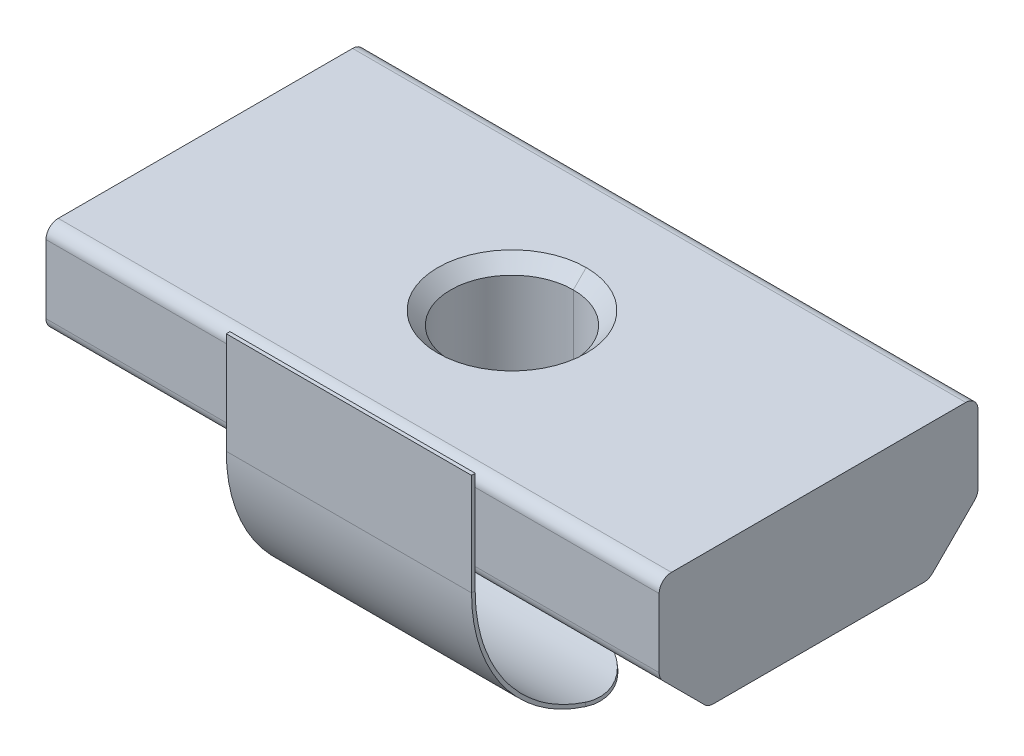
ISO-10303-21;
HEADER;
FILE_DESCRIPTION(('STEP AP214'),'2;1');
FILE_NAME('part.step','',(''),(''),'','','');
FILE_SCHEMA(('AUTOMOTIVE_DESIGN { 1 0 10303 214 1 1 1 1 }'));
ENDSEC;
DATA;
#1=APPLICATION_CONTEXT('core data for automotive mechanical design processes');
#2=APPLICATION_PROTOCOL_DEFINITION('international standard','automotive_design',2000,#1);
#3=PRODUCT_CONTEXT('',#1,'mechanical');
#4=PRODUCT('Part','Part','',(#3));
#5=PRODUCT_RELATED_PRODUCT_CATEGORY('part','',(#4));
#6=PRODUCT_DEFINITION_FORMATION('','',#4);
#7=PRODUCT_DEFINITION_CONTEXT('part definition',#1,'design');
#8=PRODUCT_DEFINITION('design','',#6,#7);
#9=PRODUCT_DEFINITION_SHAPE('','',#8);
#10=(LENGTH_UNIT() NAMED_UNIT(*) SI_UNIT(.MILLI.,.METRE.));
#11=(NAMED_UNIT(*) PLANE_ANGLE_UNIT() SI_UNIT($,.RADIAN.));
#12=(NAMED_UNIT(*) SI_UNIT($,.STERADIAN.) SOLID_ANGLE_UNIT());
#13=UNCERTAINTY_MEASURE_WITH_UNIT(LENGTH_MEASURE(1.E-05),#10,'distance_accuracy_value','');
#14=(GEOMETRIC_REPRESENTATION_CONTEXT(3) GLOBAL_UNCERTAINTY_ASSIGNED_CONTEXT((#13)) GLOBAL_UNIT_ASSIGNED_CONTEXT((#10,
#11,#12)) REPRESENTATION_CONTEXT('',''));
#15=CARTESIAN_POINT('',(0.,0.,0.));
#16=DIRECTION('',(0.,0.,1.));
#17=DIRECTION('',(1.,0.,0.));
#18=AXIS2_PLACEMENT_3D('',#15,#16,#17);
#19=CARTESIAN_POINT('',(-80.5640748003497,28.5687387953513,32.7441142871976));
#20=DIRECTION('',(0.,1.,0.));
#21=DIRECTION('',(0.,0.,1.));
#22=AXIS2_PLACEMENT_3D('',#19,#20,#21);
#23=CONICAL_SURFACE('',#22,3.025,0.785398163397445);
#24=DIRECTION('',(0.,0.70710678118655,-0.707106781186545));
#25=VECTOR('',#24,1.);
#26=CARTESIAN_POINT('',(-80.5640748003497,28.5687387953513,29.7191142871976));
#27=LINE('',#26,#25);
#28=CARTESIAN_POINT('',(-80.5640748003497,28.0437387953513,30.2441142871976));
#29=VERTEX_POINT('',#28);
#30=CARTESIAN_POINT('',(-80.5640748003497,28.5687387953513,29.7191142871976));
#31=VERTEX_POINT('',#30);
#32=EDGE_CURVE('E281',#29,#31,#27,.T.);
#33=ORIENTED_EDGE('',*,*,#32,.F.);
#34=CARTESIAN_POINT('',(-80.5640748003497,28.0437387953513,32.7441142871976));
#35=DIRECTION('',(0.,1.,0.));
#36=DIRECTION('',(0.,0.,1.));
#37=AXIS2_PLACEMENT_3D('',#34,#35,#36);
#38=CIRCLE('',#37,2.5);
#39=CARTESIAN_POINT('',(-80.5640748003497,28.0437387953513,35.2441142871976));
#40=VERTEX_POINT('',#39);
#41=EDGE_CURVE('E10',#40,#29,#38,.T.);
#42=ORIENTED_EDGE('',*,*,#41,.F.);
#43=DIRECTION('',(0.,0.70710678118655,0.707106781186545));
#44=VECTOR('',#43,1.);
#45=CARTESIAN_POINT('',(-80.5640748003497,28.5687387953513,35.7691142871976));
#46=LINE('',#45,#44);
#47=CARTESIAN_POINT('',(-80.5640748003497,28.5687387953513,35.7691142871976));
#48=VERTEX_POINT('',#47);
#49=EDGE_CURVE('E290',#40,#48,#46,.T.);
#50=ORIENTED_EDGE('',*,*,#49,.T.);
#51=CARTESIAN_POINT('',(-80.5640748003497,28.5687387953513,32.7441142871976));
#52=DIRECTION('',(0.,1.,0.));
#53=DIRECTION('',(0.,0.,1.));
#54=AXIS2_PLACEMENT_3D('',#51,#52,#53);
#55=CIRCLE('',#54,3.025);
#56=EDGE_CURVE('E282',#48,#31,#55,.T.);
#57=ORIENTED_EDGE('',*,*,#56,.T.);
#58=EDGE_LOOP('',(#33,#42,#50,#57));
#59=FACE_BOUND('',#58,.T.);
#60=ADVANCED_FACE('F16',(#59),#23,.F.);
#61=CARTESIAN_POINT('',(-80.5640748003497,28.5687387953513,32.7441142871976));
#62=DIRECTION('',(0.,1.,0.));
#63=DIRECTION('',(0.,0.,1.));
#64=AXIS2_PLACEMENT_3D('',#61,#62,#63);
#65=CYLINDRICAL_SURFACE('',#64,2.5);
#66=DIRECTION('',(0.,1.,0.));
#67=VECTOR('',#66,1.);
#68=CARTESIAN_POINT('',(-80.5640748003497,28.5687387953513,30.2441142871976));
#69=LINE('',#68,#67);
#70=CARTESIAN_POINT('',(-80.5640748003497,23.0687387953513,30.2441142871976));
#71=VERTEX_POINT('',#70);
#72=EDGE_CURVE('E263',#71,#29,#69,.T.);
#73=ORIENTED_EDGE('',*,*,#72,.F.);
#74=CARTESIAN_POINT('',(-80.5640748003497,23.0687387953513,32.7441142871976));
#75=DIRECTION('',(0.,1.,0.));
#76=DIRECTION('',(0.,0.,-1.));
#77=AXIS2_PLACEMENT_3D('',#74,#75,#76);
#78=CIRCLE('',#77,2.5);
#79=CARTESIAN_POINT('',(-80.5640748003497,23.0687387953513,35.2441142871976));
#80=VERTEX_POINT('',#79);
#81=EDGE_CURVE('E325',#80,#71,#78,.T.);
#82=ORIENTED_EDGE('',*,*,#81,.F.);
#83=DIRECTION('',(0.,1.,0.));
#84=VECTOR('',#83,1.);
#85=CARTESIAN_POINT('',(-80.5640748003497,28.5687387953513,35.2441142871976));
#86=LINE('',#85,#84);
#87=EDGE_CURVE('E266',#80,#40,#86,.T.);
#88=ORIENTED_EDGE('',*,*,#87,.T.);
#89=ORIENTED_EDGE('',*,*,#41,.T.);
#90=EDGE_LOOP('',(#73,#82,#88,#89));
#91=FACE_BOUND('',#90,.T.);
#92=ADVANCED_FACE('F262',(#91),#65,.F.);
#93=CARTESIAN_POINT('',(-75.56407480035,28.5687387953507,39.2441142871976));
#94=DIRECTION('',(1.,0.,0.));
#95=DIRECTION('',(0.,1.,0.));
#96=AXIS2_PLACEMENT_3D('',#93,#94,#95);
#97=PLANE('',#96);
#98=CARTESIAN_POINT('',(-75.56407480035,28.5687387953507,39.2441142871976));
#99=CARTESIAN_POINT('',(-75.56407480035,28.4020721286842,39.2441142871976));
#100=CARTESIAN_POINT('',(-75.56407480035,28.2354054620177,39.2441142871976));
#101=CARTESIAN_POINT('',(-75.56407480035,28.0687387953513,39.2441142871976));
#102=(BOUNDED_CURVE() B_SPLINE_CURVE(3,(#98,#99,#100,#101),.UNSPECIFIED.,.F.,
.F.) B_SPLINE_CURVE_WITH_KNOTS((4,4),(0.,0.12048192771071),
.UNSPECIFIED.) CURVE() GEOMETRIC_REPRESENTATION_ITEM() RATIONAL_B_SPLINE_CURVE((1.,1.,1.,1.)) REPRESENTATION_ITEM(''));
#103=CARTESIAN_POINT('',(-75.56407480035,28.5687387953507,39.2441142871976));
#104=VERTEX_POINT('',#103);
#105=CARTESIAN_POINT('',(-75.56407480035,28.0687387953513,39.2441142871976));
#106=VERTEX_POINT('',#105);
#107=EDGE_CURVE('E311',#104,#106,#102,.T.);
#108=ORIENTED_EDGE('',*,*,#107,.F.);
#109=CARTESIAN_POINT('',(-75.56407480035,28.5687387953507,39.3941142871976));
#110=CARTESIAN_POINT('',(-75.56407480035,28.5687387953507,39.3441142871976));
#111=CARTESIAN_POINT('',(-75.56407480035,28.5687387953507,39.2941142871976));
#112=CARTESIAN_POINT('',(-75.56407480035,28.5687387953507,39.2441142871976));
#113=(BOUNDED_CURVE() B_SPLINE_CURVE(3,(#109,#110,#111,#112),.UNSPECIFIED.,.F.,
.F.) B_SPLINE_CURVE_WITH_KNOTS((4,4),(0.,1.),
.UNSPECIFIED.) CURVE() GEOMETRIC_REPRESENTATION_ITEM() RATIONAL_B_SPLINE_CURVE((1.,1.,1.,1.)) REPRESENTATION_ITEM(''));
#114=CARTESIAN_POINT('',(-75.56407480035,28.5687387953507,39.3941142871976));
#115=VERTEX_POINT('',#114);
#116=EDGE_CURVE('E27',#115,#104,#113,.T.);
#117=ORIENTED_EDGE('',*,*,#116,.F.);
#118=CARTESIAN_POINT('',(-75.56407480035,28.5687387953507,39.3941142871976));
#119=CARTESIAN_POINT('',(-75.56407480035,27.1854054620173,39.3941142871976));
#120=CARTESIAN_POINT('',(-75.56407480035,25.8020721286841,39.3941142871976));
#121=CARTESIAN_POINT('',(-75.56407480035,24.4187387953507,39.3941142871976));
#122=(BOUNDED_CURVE() B_SPLINE_CURVE(3,(#118,#119,#120,#121),.UNSPECIFIED.,.F.,
.F.) B_SPLINE_CURVE_WITH_KNOTS((4,4),(0.,1.),
.UNSPECIFIED.) CURVE() GEOMETRIC_REPRESENTATION_ITEM() RATIONAL_B_SPLINE_CURVE((1.,1.,1.,1.)) REPRESENTATION_ITEM(''));
#123=CARTESIAN_POINT('',(-75.56407480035,24.4187387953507,39.3941142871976));
#124=VERTEX_POINT('',#123);
#125=EDGE_CURVE('E378',#115,#124,#122,.T.);
#126=ORIENTED_EDGE('',*,*,#125,.T.);
#127=CARTESIAN_POINT('',(-75.56407480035,24.4187387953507,39.3941142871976));
#128=CARTESIAN_POINT('',(-75.56407480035,24.4187387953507,39.3441142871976));
#129=CARTESIAN_POINT('',(-75.56407480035,24.4187387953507,39.2941142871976));
#130=CARTESIAN_POINT('',(-75.56407480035,24.4187387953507,39.2441142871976));
#131=(BOUNDED_CURVE() B_SPLINE_CURVE(3,(#127,#128,#129,#130),.UNSPECIFIED.,.F.,
.F.) B_SPLINE_CURVE_WITH_KNOTS((4,4),(0.,1.),
.UNSPECIFIED.) CURVE() GEOMETRIC_REPRESENTATION_ITEM() RATIONAL_B_SPLINE_CURVE((1.,1.,1.,1.)) REPRESENTATION_ITEM(''));
#132=CARTESIAN_POINT('',(-75.56407480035,24.4187387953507,39.2441142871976));
#133=VERTEX_POINT('',#132);
#134=EDGE_CURVE('E448',#124,#133,#131,.T.);
#135=ORIENTED_EDGE('',*,*,#134,.T.);
#136=CARTESIAN_POINT('',(-75.56407480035,25.2758455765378,39.2441142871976));
#137=CARTESIAN_POINT('',(-75.56407480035,24.9901433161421,39.2441142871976));
#138=CARTESIAN_POINT('',(-75.56407480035,24.7044410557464,39.2441142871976));
#139=CARTESIAN_POINT('',(-75.56407480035,24.4187387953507,39.2441142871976));
#140=(BOUNDED_CURVE() B_SPLINE_CURVE(3,(#136,#137,#138,#139),.UNSPECIFIED.,.F.,
.F.) B_SPLINE_CURVE_WITH_KNOTS((4,4),(0.793468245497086,1.),
.UNSPECIFIED.) CURVE() GEOMETRIC_REPRESENTATION_ITEM() RATIONAL_B_SPLINE_CURVE((1.,1.,1.,1.)) REPRESENTATION_ITEM(''));
#141=CARTESIAN_POINT('',(-75.56407480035,25.2758455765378,39.2441142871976));
#142=VERTEX_POINT('',#141);
#143=EDGE_CURVE('E1069',#142,#133,#140,.T.);
#144=ORIENTED_EDGE('',*,*,#143,.F.);
#145=DIRECTION('',(0.,-1.,0.));
#146=VECTOR('',#145,1.);
#147=CARTESIAN_POINT('',(-75.56407480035,28.5687387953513,39.2441142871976));
#148=LINE('',#147,#146);
#149=EDGE_CURVE('E306',#106,#142,#148,.T.);
#150=ORIENTED_EDGE('',*,*,#149,.F.);
#151=EDGE_LOOP('',(#108,#117,#126,#135,#144,#150));
#152=FACE_BOUND('',#151,.T.);
#153=ADVANCED_FACE('F1247',(#152),#97,.T.);
#154=CARTESIAN_POINT('',(-85.56407480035,28.5687387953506,39.2441142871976));
#155=DIRECTION('',(-1.,0.,0.));
#156=DIRECTION('',(0.,1.,0.));
#157=AXIS2_PLACEMENT_3D('',#154,#155,#156);
#158=PLANE('',#157);
#159=CARTESIAN_POINT('',(-85.5640748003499,24.4187387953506,39.2441142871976));
#160=CARTESIAN_POINT('',(-85.56407480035,24.7044410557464,39.2441142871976));
#161=CARTESIAN_POINT('',(-85.56407480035,24.990143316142,39.2441142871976));
#162=CARTESIAN_POINT('',(-85.56407480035,25.2758455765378,39.2441142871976));
#163=(BOUNDED_CURVE() B_SPLINE_CURVE(3,(#159,#160,#161,#162),.UNSPECIFIED.,.F.,
.F.) B_SPLINE_CURVE_WITH_KNOTS((4,4),(0.,0.206531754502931),
.UNSPECIFIED.) CURVE() GEOMETRIC_REPRESENTATION_ITEM() RATIONAL_B_SPLINE_CURVE((1.,1.,1.,1.)) REPRESENTATION_ITEM(''));
#164=CARTESIAN_POINT('',(-85.5640748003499,24.4187387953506,39.2441142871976));
#165=VERTEX_POINT('',#164);
#166=CARTESIAN_POINT('',(-85.56407480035,25.2758455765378,39.2441142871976));
#167=VERTEX_POINT('',#166);
#168=EDGE_CURVE('E1058',#165,#167,#163,.T.);
#169=ORIENTED_EDGE('',*,*,#168,.F.);
#170=CARTESIAN_POINT('',(-85.5640748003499,24.4187387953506,39.2441142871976));
#171=CARTESIAN_POINT('',(-85.56407480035,24.4187387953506,39.2941142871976));
#172=CARTESIAN_POINT('',(-85.56407480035,24.4187387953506,39.3441142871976));
#173=CARTESIAN_POINT('',(-85.5640748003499,24.4187387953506,39.3941142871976));
#174=(BOUNDED_CURVE() B_SPLINE_CURVE(3,(#170,#171,#172,#173),.UNSPECIFIED.,.F.,
.F.) B_SPLINE_CURVE_WITH_KNOTS((4,4),(0.,1.),
.UNSPECIFIED.) CURVE() GEOMETRIC_REPRESENTATION_ITEM() RATIONAL_B_SPLINE_CURVE((1.,1.,1.,1.)) REPRESENTATION_ITEM(''));
#175=CARTESIAN_POINT('',(-85.5640748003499,24.4187387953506,39.3941142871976));
#176=VERTEX_POINT('',#175);
#177=EDGE_CURVE('E317',#165,#176,#174,.T.);
#178=ORIENTED_EDGE('',*,*,#177,.T.);
#179=CARTESIAN_POINT('',(-85.5640748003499,24.4187387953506,39.3941142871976));
#180=CARTESIAN_POINT('',(-85.56407480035,25.8020721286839,39.3941142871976));
#181=CARTESIAN_POINT('',(-85.56407480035,27.1854054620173,39.3941142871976));
#182=CARTESIAN_POINT('',(-85.56407480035,28.5687387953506,39.3941142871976));
#183=(BOUNDED_CURVE() B_SPLINE_CURVE(3,(#179,#180,#181,#182),.UNSPECIFIED.,.F.,
.F.) B_SPLINE_CURVE_WITH_KNOTS((4,4),(0.,1.),
.UNSPECIFIED.) CURVE() GEOMETRIC_REPRESENTATION_ITEM() RATIONAL_B_SPLINE_CURVE((1.,1.,1.,1.)) REPRESENTATION_ITEM(''));
#184=CARTESIAN_POINT('',(-85.56407480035,28.5687387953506,39.3941142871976));
#185=VERTEX_POINT('',#184);
#186=EDGE_CURVE('E335',#176,#185,#183,.T.);
#187=ORIENTED_EDGE('',*,*,#186,.T.);
#188=CARTESIAN_POINT('',(-85.56407480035,28.5687387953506,39.2441142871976));
#189=CARTESIAN_POINT('',(-85.56407480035,28.5687387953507,39.2941142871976));
#190=CARTESIAN_POINT('',(-85.56407480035,28.5687387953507,39.3441142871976));
#191=CARTESIAN_POINT('',(-85.56407480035,28.5687387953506,39.3941142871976));
#192=(BOUNDED_CURVE() B_SPLINE_CURVE(3,(#188,#189,#190,#191),.UNSPECIFIED.,.F.,
.F.) B_SPLINE_CURVE_WITH_KNOTS((4,4),(0.,1.),
.UNSPECIFIED.) CURVE() GEOMETRIC_REPRESENTATION_ITEM() RATIONAL_B_SPLINE_CURVE((1.,1.,1.,1.)) REPRESENTATION_ITEM(''));
#193=CARTESIAN_POINT('',(-85.56407480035,28.5687387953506,39.2441142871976));
#194=VERTEX_POINT('',#193);
#195=EDGE_CURVE('E51',#194,#185,#192,.T.);
#196=ORIENTED_EDGE('',*,*,#195,.F.);
#197=CARTESIAN_POINT('',(-85.56407480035,28.0687387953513,39.2441142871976));
#198=CARTESIAN_POINT('',(-85.56407480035,28.2354054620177,39.2441142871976));
#199=CARTESIAN_POINT('',(-85.56407480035,28.4020721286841,39.2441142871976));
#200=CARTESIAN_POINT('',(-85.56407480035,28.5687387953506,39.2441142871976));
#201=(BOUNDED_CURVE() B_SPLINE_CURVE(3,(#197,#198,#199,#200),.UNSPECIFIED.,.F.,
.F.) B_SPLINE_CURVE_WITH_KNOTS((4,4),(0.879518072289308,1.),
.UNSPECIFIED.) CURVE() GEOMETRIC_REPRESENTATION_ITEM() RATIONAL_B_SPLINE_CURVE((1.,1.,1.,1.)) REPRESENTATION_ITEM(''));
#202=CARTESIAN_POINT('',(-85.56407480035,28.0687387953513,39.2441142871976));
#203=VERTEX_POINT('',#202);
#204=EDGE_CURVE('E316',#203,#194,#201,.T.);
#205=ORIENTED_EDGE('',*,*,#204,.F.);
#206=DIRECTION('',(0.,1.,0.));
#207=VECTOR('',#206,1.);
#208=CARTESIAN_POINT('',(-85.56407480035,28.5687387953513,39.2441142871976));
#209=LINE('',#208,#207);
#210=EDGE_CURVE('E356',#167,#203,#209,.T.);
#211=ORIENTED_EDGE('',*,*,#210,.F.);
#212=EDGE_LOOP('',(#169,#178,#187,#196,#205,#211));
#213=FACE_BOUND('',#212,.T.);
#214=ADVANCED_FACE('F1240',(#213),#158,.T.);
#215=CARTESIAN_POINT('',(-75.56407480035,28.5687387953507,39.2441142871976));
#216=DIRECTION('',(0.,1.,0.));
#217=DIRECTION('',(1.,0.,0.));
#218=AXIS2_PLACEMENT_3D('',#215,#216,#217);
#219=PLANE('',#218);
#220=CARTESIAN_POINT('',(-85.56407480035,28.5687387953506,39.2441142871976));
#221=CARTESIAN_POINT('',(-82.2307414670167,28.5687387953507,39.2441142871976));
#222=CARTESIAN_POINT('',(-78.8974081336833,28.5687387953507,39.2441142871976));
#223=CARTESIAN_POINT('',(-75.56407480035,28.5687387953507,39.2441142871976));
#224=(BOUNDED_CURVE() B_SPLINE_CURVE(3,(#220,#221,#222,#223),.UNSPECIFIED.,.F.,
.F.) B_SPLINE_CURVE_WITH_KNOTS((4,4),(0.,1.),
.UNSPECIFIED.) CURVE() GEOMETRIC_REPRESENTATION_ITEM() RATIONAL_B_SPLINE_CURVE((1.,1.,1.,1.)) REPRESENTATION_ITEM(''));
#225=EDGE_CURVE('E336',#194,#104,#224,.T.);
#226=ORIENTED_EDGE('',*,*,#225,.F.);
#227=ORIENTED_EDGE('',*,*,#195,.T.);
#228=CARTESIAN_POINT('',(-85.56407480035,28.5687387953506,39.3941142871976));
#229=CARTESIAN_POINT('',(-82.2307414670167,28.5687387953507,39.3941142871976));
#230=CARTESIAN_POINT('',(-78.8974081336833,28.5687387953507,39.3941142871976));
#231=CARTESIAN_POINT('',(-75.56407480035,28.5687387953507,39.3941142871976));
#232=(BOUNDED_CURVE() B_SPLINE_CURVE(3,(#228,#229,#230,#231),.UNSPECIFIED.,.F.,
.F.) B_SPLINE_CURVE_WITH_KNOTS((4,4),(0.,1.),
.UNSPECIFIED.) CURVE() GEOMETRIC_REPRESENTATION_ITEM() RATIONAL_B_SPLINE_CURVE((1.,1.,1.,1.)) REPRESENTATION_ITEM(''));
#233=EDGE_CURVE('E330',#185,#115,#232,.T.);
#234=ORIENTED_EDGE('',*,*,#233,.T.);
#235=ORIENTED_EDGE('',*,*,#116,.T.);
#236=EDGE_LOOP('',(#226,#227,#234,#235));
#237=FACE_BOUND('',#236,.T.);
#238=ADVANCED_FACE('F1613',(#237),#219,.T.);
#239=CARTESIAN_POINT('',(-75.56407480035,28.5687387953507,39.3941142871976));
#240=DIRECTION('',(0.,0.,-1.));
#241=DIRECTION('',(0.,-1.,0.));
#242=AXIS2_PLACEMENT_3D('',#239,#240,#241);
#243=PLANE('',#242);
#244=ORIENTED_EDGE('',*,*,#233,.F.);
#245=ORIENTED_EDGE('',*,*,#186,.F.);
#246=CARTESIAN_POINT('',(-75.56407480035,24.4187387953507,39.3941142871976));
#247=CARTESIAN_POINT('',(-78.8974081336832,24.4187387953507,39.3941142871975));
#248=CARTESIAN_POINT('',(-82.2307414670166,24.4187387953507,39.3941142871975));
#249=CARTESIAN_POINT('',(-85.5640748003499,24.4187387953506,39.3941142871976));
#250=(BOUNDED_CURVE() B_SPLINE_CURVE(3,(#246,#247,#248,#249),.UNSPECIFIED.,.F.,
.F.) B_SPLINE_CURVE_WITH_KNOTS((4,4),(0.,1.),
.UNSPECIFIED.) CURVE() GEOMETRIC_REPRESENTATION_ITEM() RATIONAL_B_SPLINE_CURVE((1.,1.,1.,1.)) REPRESENTATION_ITEM(''));
#251=EDGE_CURVE('E1143',#124,#176,#250,.T.);
#252=ORIENTED_EDGE('',*,*,#251,.F.);
#253=ORIENTED_EDGE('',*,*,#125,.F.);
#254=EDGE_LOOP('',(#244,#245,#252,#253));
#255=FACE_BOUND('',#254,.T.);
#256=ADVANCED_FACE('F421',(#255),#243,.F.);
#257=CARTESIAN_POINT('',(-75.56407480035,28.5687387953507,39.2441142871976));
#258=DIRECTION('',(0.,0.,-1.));
#259=DIRECTION('',(0.,-1.,0.));
#260=AXIS2_PLACEMENT_3D('',#257,#258,#259);
#261=PLANE('',#260);
#262=ORIENTED_EDGE('',*,*,#107,.T.);
#263=CARTESIAN_POINT('',(-85.56407480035,28.0687387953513,39.2441142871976));
#264=CARTESIAN_POINT('',(-82.2307414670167,28.0687387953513,39.2441142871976));
#265=CARTESIAN_POINT('',(-78.8974081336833,28.0687387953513,39.2441142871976));
#266=CARTESIAN_POINT('',(-75.56407480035,28.0687387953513,39.2441142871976));
#267=(BOUNDED_CURVE() B_SPLINE_CURVE(3,(#263,#264,#265,#266),.UNSPECIFIED.,.F.,
.F.) B_SPLINE_CURVE_WITH_KNOTS((4,4),(0.299999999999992,0.699999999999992),
.UNSPECIFIED.) CURVE() GEOMETRIC_REPRESENTATION_ITEM() RATIONAL_B_SPLINE_CURVE((1.,1.,1.,1.)) REPRESENTATION_ITEM(''));
#268=EDGE_CURVE('E348',#203,#106,#267,.T.);
#269=ORIENTED_EDGE('',*,*,#268,.F.);
#270=ORIENTED_EDGE('',*,*,#204,.T.);
#271=ORIENTED_EDGE('',*,*,#225,.T.);
#272=EDGE_LOOP('',(#262,#269,#270,#271));
#273=FACE_BOUND('',#272,.T.);
#274=ADVANCED_FACE('F1114',(#273),#261,.T.);
#275=CARTESIAN_POINT('',(-85.5640748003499,24.4187387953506,32.7441142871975));
#276=DIRECTION('',(1.,0.,0.));
#277=DIRECTION('',(0.,1.,0.));
#278=AXIS2_PLACEMENT_3D('',#275,#276,#277);
#279=PLANE('',#278);
#280=CARTESIAN_POINT('',(-85.5640748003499,18.0722239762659,34.7301277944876));
#281=CARTESIAN_POINT('',(-85.5640748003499,18.1271680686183,34.7378496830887));
#282=CARTESIAN_POINT('',(-85.5640748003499,18.1821121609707,34.7455715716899));
#283=CARTESIAN_POINT('',(-85.5640748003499,18.2370562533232,34.7532934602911));
#284=(BOUNDED_CURVE() B_SPLINE_CURVE(3,(#280,#281,#282,#283),.UNSPECIFIED.,.F.,
.F.) B_SPLINE_CURVE_WITH_KNOTS((4,4),(0.,1.),
.UNSPECIFIED.) CURVE() GEOMETRIC_REPRESENTATION_ITEM() RATIONAL_B_SPLINE_CURVE((1.,1.,1.,1.)) REPRESENTATION_ITEM(''));
#285=CARTESIAN_POINT('',(-85.5640748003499,18.0722239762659,34.7301277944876));
#286=VERTEX_POINT('',#285);
#287=CARTESIAN_POINT('',(-85.5640748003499,18.2370562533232,34.7532934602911));
#288=VERTEX_POINT('',#287);
#289=EDGE_CURVE('E1154',#286,#288,#284,.T.);
#290=ORIENTED_EDGE('',*,*,#289,.F.);
#291=CARTESIAN_POINT('',(-85.5640748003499,24.4187387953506,32.7441142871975));
#292=DIRECTION('',(1.,0.,0.));
#293=DIRECTION('',(0.,0.,1.));
#294=AXIS2_PLACEMENT_3D('',#291,#292,#293);
#295=CIRCLE('',#294,6.65);
#296=EDGE_CURVE('E402',#176,#286,#295,.T.);
#297=ORIENTED_EDGE('',*,*,#296,.F.);
#298=ORIENTED_EDGE('',*,*,#177,.F.);
#299=CARTESIAN_POINT('',(-85.5640748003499,24.4187387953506,39.2441142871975));
#300=CARTESIAN_POINT('',(-85.5640748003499,23.3893220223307,39.2441142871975));
#301=CARTESIAN_POINT('',(-85.5640748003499,22.410270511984,38.9260278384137));
#302=CARTESIAN_POINT('',(-85.5640748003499,21.4312340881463,38.6079462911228));
#303=CARTESIAN_POINT('',(-85.5640748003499,20.5983765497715,38.0029004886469));
#304=CARTESIAN_POINT('',(-85.5640748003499,19.7655363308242,37.397867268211));
#305=CARTESIAN_POINT('',(-85.5640748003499,19.1603919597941,36.5650812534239));
#306=CARTESIAN_POINT('',(-85.5640748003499,18.5552570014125,35.7323081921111));
#307=CARTESIAN_POINT('',(-85.5640748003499,18.2370562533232,34.7532934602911));
#308=B_SPLINE_CURVE_WITH_KNOTS('',2,(#299,#300,#301,#302,#303,#304,#305,#306,#307),
.UNSPECIFIED.,.F.,.F.,(3,2,2,2,3),(0.,0.25,0.5,0.75,1.),.UNSPECIFIED.);
#309=EDGE_CURVE('E1098',#165,#288,#308,.T.);
#310=ORIENTED_EDGE('',*,*,#309,.T.);
#311=EDGE_LOOP('',(#290,#297,#298,#310));
#312=FACE_BOUND('',#311,.T.);
#313=ADVANCED_FACE('F1104',(#312),#279,.F.);
#314=CARTESIAN_POINT('',(-75.5640748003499,16.8525131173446,38.7983854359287));
#315=DIRECTION('',(0.,0.990268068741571,0.139173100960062));
#316=DIRECTION('',(1.,0.,0.));
#317=AXIS2_PLACEMENT_3D('',#314,#315,#316);
#318=PLANE('',#317);
#319=CARTESIAN_POINT('',(-82.5640748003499,17.4368197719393,34.640827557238));
#320=DIRECTION('',(0.,0.990268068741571,0.139173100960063));
#321=DIRECTION('',(0.,0.139173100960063,-0.990268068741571));
#322=AXIS2_PLACEMENT_3D('',#319,#320,#321);
#323=CIRCLE('',#322,3.);
#324=CARTESIAN_POINT('',(-82.5640748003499,17.8543390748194,31.6700233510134));
#325=VERTEX_POINT('',#324);
#326=CARTESIAN_POINT('',(-83.5009768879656,17.8334561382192,31.8186131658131));
#327=VERTEX_POINT('',#326);
#328=EDGE_CURVE('E462',#325,#327,#323,.T.);
#329=ORIENTED_EDGE('',*,*,#328,.F.);
#330=CARTESIAN_POINT('',(-82.5640748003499,17.8543390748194,31.6700233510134));
#331=CARTESIAN_POINT('',(-81.2307414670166,17.8543390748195,31.6700233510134));
#332=CARTESIAN_POINT('',(-79.8974081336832,17.8543390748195,31.6700233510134));
#333=CARTESIAN_POINT('',(-78.5640748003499,17.8543390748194,31.6700233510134));
#334=(BOUNDED_CURVE() B_SPLINE_CURVE(3,(#330,#331,#332,#333),.UNSPECIFIED.,.F.,
.F.) B_SPLINE_CURVE_WITH_KNOTS((4,4),(0.,1.),
.UNSPECIFIED.) CURVE() GEOMETRIC_REPRESENTATION_ITEM() RATIONAL_B_SPLINE_CURVE((1.,1.,1.,1.)) REPRESENTATION_ITEM(''));
#335=CARTESIAN_POINT('',(-78.5640748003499,17.8543390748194,31.6700233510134));
#336=VERTEX_POINT('',#335);
#337=EDGE_CURVE('E1160',#325,#336,#334,.T.);
#338=ORIENTED_EDGE('',*,*,#337,.T.);
#339=CARTESIAN_POINT('',(-78.56407480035,17.4368197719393,34.640827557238));
#340=DIRECTION('',(0.,0.990268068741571,0.139173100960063));
#341=DIRECTION('',(0.312300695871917,0.132212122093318,-0.940738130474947));
#342=AXIS2_PLACEMENT_3D('',#339,#340,#341);
#343=CIRCLE('',#342,3.);
#344=CARTESIAN_POINT('',(-77.6271727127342,17.8334561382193,31.8186131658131));
#345=VERTEX_POINT('',#344);
#346=EDGE_CURVE('E1308',#345,#336,#343,.T.);
#347=ORIENTED_EDGE('',*,*,#346,.F.);
#348=CARTESIAN_POINT('',(-83.5009768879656,17.8334561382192,31.8186131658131));
#349=CARTESIAN_POINT('',(-81.5430421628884,17.8334561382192,31.8186131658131));
#350=CARTESIAN_POINT('',(-79.5851074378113,17.8334561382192,31.8186131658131));
#351=CARTESIAN_POINT('',(-77.6271727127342,17.8334561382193,31.8186131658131));
#352=(BOUNDED_CURVE() B_SPLINE_CURVE(3,(#348,#349,#350,#351),.UNSPECIFIED.,.F.,
.F.) B_SPLINE_CURVE_WITH_KNOTS((4,4),(0.,1.),
.UNSPECIFIED.) CURVE() GEOMETRIC_REPRESENTATION_ITEM() RATIONAL_B_SPLINE_CURVE((1.,1.,1.,1.)) REPRESENTATION_ITEM(''));
#353=EDGE_CURVE('E440',#327,#345,#352,.T.);
#354=ORIENTED_EDGE('',*,*,#353,.F.);
#355=EDGE_LOOP('',(#329,#338,#347,#354));
#356=FACE_BOUND('',#355,.T.);
#357=ADVANCED_FACE('F1113',(#356),#318,.F.);
#358=CARTESIAN_POINT('',(-75.56407480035,24.4187387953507,32.7441142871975));
#359=DIRECTION('',(1.,0.,0.));
#360=DIRECTION('',(0.,1.,0.));
#361=AXIS2_PLACEMENT_3D('',#358,#359,#360);
#362=PLANE('',#361);
#363=CARTESIAN_POINT('',(-75.56407480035,18.2370562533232,34.7532934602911));
#364=CARTESIAN_POINT('',(-75.56407480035,18.5550838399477,35.7317754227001));
#365=CARTESIAN_POINT('',(-75.56407480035,19.1603919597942,36.5650812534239));
#366=CARTESIAN_POINT('',(-75.56407480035,19.7647543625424,37.3970851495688));
#367=CARTESIAN_POINT('',(-75.56407480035,20.5983765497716,38.0029004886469));
#368=CARTESIAN_POINT('',(-75.56407480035,21.4302488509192,38.6074441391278));
#369=CARTESIAN_POINT('',(-75.56407480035,22.4102705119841,38.9260278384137));
#370=CARTESIAN_POINT('',(-75.56407480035,23.3887625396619,39.2441142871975));
#371=CARTESIAN_POINT('',(-75.56407480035,24.4187387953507,39.2441142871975));
#372=B_SPLINE_CURVE_WITH_KNOTS('',2,(#363,#364,#365,#366,#367,#368,#369,#370,#371),
.UNSPECIFIED.,.F.,.F.,(3,2,2,2,3),(0.,0.25,0.5,0.75,1.),.UNSPECIFIED.);
#373=CARTESIAN_POINT('',(-75.5640748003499,18.2370562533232,34.7532934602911));
#374=VERTEX_POINT('',#373);
#375=EDGE_CURVE('E1194',#374,#133,#372,.T.);
#376=ORIENTED_EDGE('',*,*,#375,.T.);
#377=ORIENTED_EDGE('',*,*,#134,.F.);
#378=CARTESIAN_POINT('',(-75.5640748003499,24.4187387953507,32.7441142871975));
#379=DIRECTION('',(-1.,0.,0.));
#380=DIRECTION('',(0.,-0.954363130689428,0.298648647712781));
#381=AXIS2_PLACEMENT_3D('',#378,#379,#380);
#382=CIRCLE('',#381,6.65);
#383=CARTESIAN_POINT('',(-75.5640748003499,18.0722239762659,34.7301277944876));
#384=VERTEX_POINT('',#383);
#385=EDGE_CURVE('E1149',#384,#124,#382,.T.);
#386=ORIENTED_EDGE('',*,*,#385,.F.);
#387=CARTESIAN_POINT('',(-75.5640748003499,18.2370562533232,34.7532934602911));
#388=CARTESIAN_POINT('',(-75.56407480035,18.1821121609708,34.7455715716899));
#389=CARTESIAN_POINT('',(-75.56407480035,18.1271680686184,34.7378496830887));
#390=CARTESIAN_POINT('',(-75.5640748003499,18.0722239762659,34.7301277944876));
#391=(BOUNDED_CURVE() B_SPLINE_CURVE(3,(#387,#388,#389,#390),.UNSPECIFIED.,.F.,
.F.) B_SPLINE_CURVE_WITH_KNOTS((4,4),(0.,1.),
.UNSPECIFIED.) CURVE() GEOMETRIC_REPRESENTATION_ITEM() RATIONAL_B_SPLINE_CURVE((1.,1.,1.,1.)) REPRESENTATION_ITEM(''));
#392=EDGE_CURVE('E1321',#374,#384,#391,.T.);
#393=ORIENTED_EDGE('',*,*,#392,.F.);
#394=EDGE_LOOP('',(#376,#377,#386,#393));
#395=FACE_BOUND('',#394,.T.);
#396=ADVANCED_FACE('F420',(#395),#362,.T.);
#397=CARTESIAN_POINT('',(-85.5640748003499,24.4187387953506,32.7441142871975));
#398=DIRECTION('',(-1.,0.,0.));
#399=DIRECTION('',(0.,-0.990268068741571,-0.139173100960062));
#400=AXIS2_PLACEMENT_3D('',#397,#398,#399);
#401=CYLINDRICAL_SURFACE('',#400,6.65);
#402=ORIENTED_EDGE('',*,*,#385,.T.);
#403=ORIENTED_EDGE('',*,*,#251,.T.);
#404=ORIENTED_EDGE('',*,*,#296,.T.);
#405=CARTESIAN_POINT('',(-83.5009768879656,17.8334561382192,31.8186131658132));
#406=CARTESIAN_POINT('',(-83.5468930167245,17.8313566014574,31.833560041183));
#407=CARTESIAN_POINT('',(-83.592443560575,17.8291725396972,31.8496173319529));
#408=CARTESIAN_POINT('',(-83.6805306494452,17.8247771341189,31.8830874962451));
#409=CARTESIAN_POINT('',(-83.7231065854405,17.8225721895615,31.9003976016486));
#410=CARTESIAN_POINT('',(-83.8052734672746,17.8181818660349,31.9360359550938));
#411=CARTESIAN_POINT('',(-83.8449063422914,17.8160011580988,31.9542681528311));
#412=CARTESIAN_POINT('',(-83.9212381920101,17.8117050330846,31.991434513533));
#413=CARTESIAN_POINT('',(-83.9579808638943,17.8095923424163,32.0102792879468));
#414=CARTESIAN_POINT('',(-84.028600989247,17.8054742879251,32.0483776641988));
#415=CARTESIAN_POINT('',(-84.0625232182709,17.8034695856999,32.0675483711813));
#416=CARTESIAN_POINT('',(-84.1275850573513,17.7996072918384,32.1060282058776));
#417=CARTESIAN_POINT('',(-84.158769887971,17.7977480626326,32.1252607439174));
#418=CARTESIAN_POINT('',(-84.2184503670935,17.7942113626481,32.1636162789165));
#419=CARTESIAN_POINT('',(-84.2469910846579,17.7925298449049,32.1826687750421));
#420=CARTESIAN_POINT('',(-84.3014831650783,17.7893878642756,32.2204384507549));
#421=CARTESIAN_POINT('',(-84.3274789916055,17.787920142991,32.2390909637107));
#422=CARTESIAN_POINT('',(-84.3882182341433,17.7846044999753,32.284193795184));
#423=CARTESIAN_POINT('',(-84.4226956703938,17.7828130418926,32.3110078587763));
#424=CARTESIAN_POINT('',(-84.4896272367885,17.779526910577,32.3654965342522));
#425=CARTESIAN_POINT('',(-84.5221099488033,17.7780262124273,32.3931357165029));
#426=CARTESIAN_POINT('',(-84.5850807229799,17.7753508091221,32.4491223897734));
#427=CARTESIAN_POINT('',(-84.6155980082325,17.7741691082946,32.4774366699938));
#428=CARTESIAN_POINT('',(-84.6746739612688,17.7721509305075,32.5346268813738));
#429=CARTESIAN_POINT('',(-84.7032623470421,17.7713066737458,32.563471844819));
#430=CARTESIAN_POINT('',(-84.7585243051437,17.7699838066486,32.6215850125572));
#431=CARTESIAN_POINT('',(-84.7852279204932,17.7694965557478,32.6508244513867));
#432=CARTESIAN_POINT('',(-84.8367706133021,17.7689066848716,32.7095958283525));
#433=CARTESIAN_POINT('',(-84.8616399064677,17.7687945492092,32.7391011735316));
#434=CARTESIAN_POINT('',(-84.9095701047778,17.7689721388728,32.7982816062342));
#435=CARTESIAN_POINT('',(-84.9326612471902,17.7692514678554,32.8279322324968));
#436=CARTESIAN_POINT('',(-84.9770956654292,17.7702310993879,32.8872879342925));
#437=CARTESIAN_POINT('',(-84.9984690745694,17.770920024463,32.9169706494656));
#438=CARTESIAN_POINT('',(-85.0427929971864,17.7728695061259,32.9809906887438));
#439=CARTESIAN_POINT('',(-85.0655893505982,17.7741925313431,33.0154330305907));
#440=CARTESIAN_POINT('',(-85.1095138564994,17.7774206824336,33.0848893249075));
#441=CARTESIAN_POINT('',(-85.1306555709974,17.7793202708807,33.119894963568));
#442=CARTESIAN_POINT('',(-85.1712875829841,17.7837163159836,33.1903908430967));
#443=CARTESIAN_POINT('',(-85.1907911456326,17.7862071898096,33.2258737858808));
#444=CARTESIAN_POINT('',(-85.2281675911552,17.7917968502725,33.2972398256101));
#445=CARTESIAN_POINT('',(-85.2460533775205,17.7948900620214,33.3331166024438));
#446=CARTESIAN_POINT('',(-85.2802188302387,17.8016958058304,33.405189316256));
#447=CARTESIAN_POINT('',(-85.2965109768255,17.8054027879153,33.441379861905));
#448=CARTESIAN_POINT('',(-85.3275171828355,17.8134468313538,33.5140024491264));
#449=CARTESIAN_POINT('',(-85.342243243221,17.81777839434,33.5504299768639));
#450=CARTESIAN_POINT('',(-85.3701485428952,17.8270816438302,33.6234523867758));
#451=CARTESIAN_POINT('',(-85.3833392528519,17.8320479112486,33.6600435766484));
#452=CARTESIAN_POINT('',(-85.4082079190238,17.8426310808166,33.7333225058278));
#453=CARTESIAN_POINT('',(-85.4198967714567,17.8482426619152,33.7700073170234));
#454=CARTESIAN_POINT('',(-85.4420679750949,17.8602687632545,33.844308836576));
#455=CARTESIAN_POINT('',(-85.4525263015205,17.8666953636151,33.8819307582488));
#456=CARTESIAN_POINT('',(-85.4720365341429,17.880290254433,33.9575276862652));
#457=CARTESIAN_POINT('',(-85.4810841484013,17.8874607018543,33.9955034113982));
#458=CARTESIAN_POINT('',(-85.497774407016,17.9025515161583,34.0717531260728));
#459=CARTESIAN_POINT('',(-85.5054122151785,17.9104743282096,34.110027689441));
#460=CARTESIAN_POINT('',(-85.5192865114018,17.9270770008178,34.1868209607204));
#461=CARTESIAN_POINT('',(-85.5255176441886,17.9357595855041,34.2253400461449));
#462=CARTESIAN_POINT('',(-85.5365842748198,17.9538891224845,34.3025689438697));
#463=CARTESIAN_POINT('',(-85.5414139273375,17.9633390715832,34.34127888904));
#464=CARTESIAN_POINT('',(-85.5496853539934,17.9830104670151,34.4188369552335));
#465=CARTESIAN_POINT('',(-85.5531208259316,17.9932351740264,34.4576849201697));
#466=CARTESIAN_POINT('',(-85.5586133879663,18.0144631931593,34.5354671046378));
#467=CARTESIAN_POINT('',(-85.5606637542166,18.0254700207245,34.5744008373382));
#468=CARTESIAN_POINT('',(-85.5633982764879,18.0482690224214,34.6523044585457));
#469=CARTESIAN_POINT('',(-85.5640753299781,18.060064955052,34.6912734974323));
#470=CARTESIAN_POINT('',(-85.5640748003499,18.0722239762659,34.7301277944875));
#471=B_SPLINE_CURVE_WITH_KNOTS('',3,(#405,#406,#407,#408,#409,#410,#411,#412,#413,#414,#415,
#416,#417,#418,#419,#420,#421,#422,#423,#424,#425,#426,#427,#428,#429,#430,#431,#432,#433,#434,
#435,#436,#437,#438,#439,#440,#441,#442,#443,#444,#445,#446,#447,#448,#449,#450,#451,#452,#453,
#454,#455,#456,#457,#458,#459,#460,#461,#462,#463,#464,#465,#466,#467,#468,#469,#470),
.UNSPECIFIED.,.F.,.F.,(4,2,2,2,2,2,2,2,2,2,2,2,2,2,2,2,2,2,2,2,2,2,2,2,2,2,2,2,2,2,2,2,4),(0.,
0.144985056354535,0.282975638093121,0.413973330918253,0.537980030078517,0.654998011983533,
0.765030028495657,0.868079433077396,0.964150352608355,1.09524537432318,1.22323507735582,
1.34813474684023,1.4699608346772,1.58873107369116,1.70446460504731,1.81718212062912,
1.92690602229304,2.05083799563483,2.17361546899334,2.29527682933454,2.41586152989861,
2.5354100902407,2.65396409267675,2.77156617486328,2.88826001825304,3.00694755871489,
3.12598942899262,3.2454323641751,3.36532263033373,3.48570597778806,3.60662759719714,
3.72813207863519,3.85026337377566),.UNSPECIFIED.);
#472=EDGE_CURVE('E1161',#327,#286,#471,.T.);
#473=ORIENTED_EDGE('',*,*,#472,.F.);
#474=ORIENTED_EDGE('',*,*,#353,.T.);
#475=CARTESIAN_POINT('',(-75.5640748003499,18.0722239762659,34.7301277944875));
#476=CARTESIAN_POINT('',(-75.5640742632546,18.0600326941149,34.691170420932));
#477=CARTESIAN_POINT('',(-75.5647549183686,18.0482066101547,34.6520976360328));
#478=CARTESIAN_POINT('',(-75.5675041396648,18.0253510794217,34.5739844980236));
#479=CARTESIAN_POINT('',(-75.5695656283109,18.0143178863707,34.534944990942));
#480=CARTESIAN_POINT('',(-75.5750882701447,17.9930408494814,34.456949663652));
#481=CARTESIAN_POINT('',(-75.5785427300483,17.9827935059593,34.4179943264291));
#482=CARTESIAN_POINT('',(-75.5868602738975,17.9630804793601,34.3402203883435));
#483=CARTESIAN_POINT('',(-75.5917170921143,17.9536115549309,34.3014019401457));
#484=CARTESIAN_POINT('',(-75.6028464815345,17.9354476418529,34.2239553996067));
#485=CARTESIAN_POINT('',(-75.6091132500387,17.9267496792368,34.1853271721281));
#486=CARTESIAN_POINT('',(-75.6230675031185,17.9101197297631,34.1083154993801));
#487=CARTESIAN_POINT('',(-75.6307496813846,17.902185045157,34.0699316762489));
#488=CARTESIAN_POINT('',(-75.6475376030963,17.8870739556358,33.9934638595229));
#489=CARTESIAN_POINT('',(-75.6566385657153,17.8798951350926,33.9553792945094));
#490=CARTESIAN_POINT('',(-75.6762646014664,17.8662866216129,33.8795656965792));
#491=CARTESIAN_POINT('',(-75.6867854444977,17.8598548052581,33.8418359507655));
#492=CARTESIAN_POINT('',(-75.7090585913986,17.8478393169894,33.7674269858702));
#493=CARTESIAN_POINT('',(-75.7207828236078,17.8422415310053,33.7307416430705));
#494=CARTESIAN_POINT('',(-75.7457251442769,17.8316861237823,33.6574577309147));
#495=CARTESIAN_POINT('',(-75.7589543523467,17.8267339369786,33.6208621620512));
#496=CARTESIAN_POINT('',(-75.7869400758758,17.8174587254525,33.5478274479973));
#497=CARTESIAN_POINT('',(-75.8017082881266,17.8131412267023,33.5113920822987));
#498=CARTESIAN_POINT('',(-75.8328027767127,17.8051252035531,33.4387506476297));
#499=CARTESIAN_POINT('',(-75.8491412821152,17.8014322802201,33.4025491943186));
#500=CARTESIAN_POINT('',(-75.8834039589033,17.7946544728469,33.3304519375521));
#501=CARTESIAN_POINT('',(-75.9013408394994,17.7915752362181,33.2945616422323));
#502=CARTESIAN_POINT('',(-75.9388244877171,17.7860132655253,33.2231663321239));
#503=CARTESIAN_POINT('',(-75.9583843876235,17.7835361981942,33.1876677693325));
#504=CARTESIAN_POINT('',(-75.9991345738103,17.7791674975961,33.1171389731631));
#505=CARTESIAN_POINT('',(-76.020338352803,17.7772815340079,33.0821161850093));
#506=CARTESIAN_POINT('',(-76.0643929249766,17.7740800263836,33.0126245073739));
#507=CARTESIAN_POINT('',(-76.0872575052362,17.7727700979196,32.9781640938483));
#508=CARTESIAN_POINT('',(-76.1316499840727,17.7708482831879,32.9142041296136));
#509=CARTESIAN_POINT('',(-76.153020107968,17.7701725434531,32.8845967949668));
#510=CARTESIAN_POINT('',(-76.197446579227,17.769217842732,32.8253880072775));
#511=CARTESIAN_POINT('',(-76.2205331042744,17.7689502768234,32.7958090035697));
#512=CARTESIAN_POINT('',(-76.2684528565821,17.7687945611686,32.7367679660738));
#513=CARTESIAN_POINT('',(-76.2933163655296,17.7689168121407,32.7073304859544));
#514=CARTESIAN_POINT('',(-76.3448464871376,17.7695253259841,32.6486910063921));
#515=CARTESIAN_POINT('',(-76.3715433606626,17.7700211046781,32.6195156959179));
#516=CARTESIAN_POINT('',(-76.4267910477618,17.7713594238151,32.5615269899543));
#517=CARTESIAN_POINT('',(-76.4553719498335,17.7722105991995,32.5327424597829));
#518=CARTESIAN_POINT('',(-76.5144323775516,17.7742410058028,32.4756693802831));
#519=CARTESIAN_POINT('',(-76.5449416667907,17.7754280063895,32.4474119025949));
#520=CARTESIAN_POINT('',(-76.6078961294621,17.7781124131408,32.3915351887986));
#521=CARTESIAN_POINT('',(-76.6403705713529,17.7796168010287,32.3639492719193));
#522=CARTESIAN_POINT('',(-76.7072855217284,17.7829086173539,32.3095635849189));
#523=CARTESIAN_POINT('',(-76.7417546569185,17.7847020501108,32.2827993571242));
#524=CARTESIAN_POINT('',(-76.802437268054,17.7880175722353,32.2378105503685));
#525=CARTESIAN_POINT('',(-76.8283845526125,17.7894833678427,32.2192213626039));
#526=CARTESIAN_POINT('',(-76.8827728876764,17.7926206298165,32.1815788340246));
#527=CARTESIAN_POINT('',(-76.9112581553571,17.7942993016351,32.1625898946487));
#528=CARTESIAN_POINT('',(-76.9708205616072,17.7978295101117,32.1243609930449));
#529=CARTESIAN_POINT('',(-77.0019425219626,17.7996850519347,32.1051912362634));
#530=CARTESIAN_POINT('',(-77.066870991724,17.8035393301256,32.0668354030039));
#531=CARTESIAN_POINT('',(-77.1007224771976,17.8055396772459,32.047725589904));
#532=CARTESIAN_POINT('',(-77.1711931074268,17.8096485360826,32.0097462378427));
#533=CARTESIAN_POINT('',(-77.2078567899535,17.8117563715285,31.9909592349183));
#534=CARTESIAN_POINT('',(-77.2840223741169,17.8160424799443,31.9539043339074));
#535=CARTESIAN_POINT('',(-77.32356774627,17.8182180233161,31.9357254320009));
#536=CARTESIAN_POINT('',(-77.4055511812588,17.8225979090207,31.9001881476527));
#537=CARTESIAN_POINT('',(-77.4480309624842,17.8247975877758,31.8829253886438));
#538=CARTESIAN_POINT('',(-77.5359173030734,17.8291825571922,31.8495428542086));
#539=CARTESIAN_POINT('',(-77.5813630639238,17.831361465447,31.8335253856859));
#540=CARTESIAN_POINT('',(-77.6271727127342,17.8334561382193,31.8186131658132));
#541=B_SPLINE_CURVE_WITH_KNOTS('',3,(#475,#476,#477,#478,#479,#480,#481,#482,#483,#484,#485,
#486,#487,#488,#489,#490,#491,#492,#493,#494,#495,#496,#497,#498,#499,#500,#501,#502,#503,#504,
#505,#506,#507,#508,#509,#510,#511,#512,#513,#514,#515,#516,#517,#518,#519,#520,#521,#522,#523,
#524,#525,#526,#527,#528,#529,#530,#531,#532,#533,#534,#535,#536,#537,#538,#539,#540),
.UNSPECIFIED.,.F.,.F.,(4,2,2,2,2,2,2,2,2,2,2,2,2,2,2,2,2,2,2,2,2,2,2,2,2,2,2,2,2,2,2,2,4),(0.,
0.122455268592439,0.244287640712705,0.365541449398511,0.486261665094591,0.606493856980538,
0.726284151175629,0.845679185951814,0.964726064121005,1.08144735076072,1.19909518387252,
1.31771333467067,1.43734450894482,1.5580303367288,1.67981136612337,1.8027270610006,
1.92681580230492,2.03634994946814,2.14888937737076,2.26445634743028,2.38307141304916,
2.50475357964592,2.62952044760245,2.75738834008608,2.88837241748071,2.98421438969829,
3.08701962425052,3.19679220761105,3.3135354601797,3.43725210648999,3.56794440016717,
3.70561421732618,3.85026312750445),.UNSPECIFIED.);
#542=EDGE_CURVE('E571',#384,#345,#541,.T.);
#543=ORIENTED_EDGE('',*,*,#542,.F.);
#544=EDGE_LOOP('',(#402,#403,#404,#473,#474,#543));
#545=FACE_BOUND('',#544,.T.);
#546=ADVANCED_FACE('F409',(#545),#401,.T.);
#547=CARTESIAN_POINT('',(-75.5640748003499,17.8543390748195,31.6700233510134));
#548=DIRECTION('',(0.,-0.139173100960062,0.990268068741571));
#549=DIRECTION('',(-1.,0.,0.));
#550=AXIS2_PLACEMENT_3D('',#547,#548,#549);
#551=PLANE('',#550);
#552=CARTESIAN_POINT('',(-82.5640748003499,18.0028792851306,31.6908993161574));
#553=CARTESIAN_POINT('',(-82.5640748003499,17.9533658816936,31.6839406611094));
#554=CARTESIAN_POINT('',(-82.5640748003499,17.9038524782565,31.6769820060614));
#555=CARTESIAN_POINT('',(-82.5640748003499,17.8543390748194,31.6700233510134));
#556=(BOUNDED_CURVE() B_SPLINE_CURVE(3,(#552,#553,#554,#555),.UNSPECIFIED.,.F.,
.F.) B_SPLINE_CURVE_WITH_KNOTS((4,4),(0.,1.),
.UNSPECIFIED.) CURVE() GEOMETRIC_REPRESENTATION_ITEM() RATIONAL_B_SPLINE_CURVE((1.,1.,1.,1.)) REPRESENTATION_ITEM(''));
#557=CARTESIAN_POINT('',(-82.5640748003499,18.0028792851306,31.6908993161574));
#558=VERTEX_POINT('',#557);
#559=EDGE_CURVE('E1188',#558,#325,#556,.T.);
#560=ORIENTED_EDGE('',*,*,#559,.F.);
#561=CARTESIAN_POINT('',(-78.5640748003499,18.0028792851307,31.6908993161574));
#562=CARTESIAN_POINT('',(-79.8974081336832,18.0028792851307,31.6908993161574));
#563=CARTESIAN_POINT('',(-81.2307414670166,18.0028792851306,31.6908993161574));
#564=CARTESIAN_POINT('',(-82.5640748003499,18.0028792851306,31.6908993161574));
#565=(BOUNDED_CURVE() B_SPLINE_CURVE(3,(#561,#562,#563,#564),.UNSPECIFIED.,.F.,
.F.) B_SPLINE_CURVE_WITH_KNOTS((4,4),(0.,1.),
.UNSPECIFIED.) CURVE() GEOMETRIC_REPRESENTATION_ITEM() RATIONAL_B_SPLINE_CURVE((1.,1.,1.,1.)) REPRESENTATION_ITEM(''));
#566=CARTESIAN_POINT('',(-78.5640748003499,18.0028792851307,31.6908993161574));
#567=VERTEX_POINT('',#566);
#568=EDGE_CURVE('E597',#567,#558,#565,.T.);
#569=ORIENTED_EDGE('',*,*,#568,.F.);
#570=CARTESIAN_POINT('',(-78.5640748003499,17.8543390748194,31.6700233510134));
#571=CARTESIAN_POINT('',(-78.56407480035,17.9038524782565,31.6769820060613));
#572=CARTESIAN_POINT('',(-78.56407480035,17.9533658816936,31.6839406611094));
#573=CARTESIAN_POINT('',(-78.5640748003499,18.0028792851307,31.6908993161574));
#574=(BOUNDED_CURVE() B_SPLINE_CURVE(3,(#570,#571,#572,#573),.UNSPECIFIED.,.F.,
.F.) B_SPLINE_CURVE_WITH_KNOTS((4,4),(0.,1.),
.UNSPECIFIED.) CURVE() GEOMETRIC_REPRESENTATION_ITEM() RATIONAL_B_SPLINE_CURVE((1.,1.,1.,1.)) REPRESENTATION_ITEM(''));
#575=EDGE_CURVE('E1301',#336,#567,#574,.T.);
#576=ORIENTED_EDGE('',*,*,#575,.F.);
#577=ORIENTED_EDGE('',*,*,#337,.F.);
#578=EDGE_LOOP('',(#560,#569,#576,#577));
#579=FACE_BOUND('',#578,.T.);
#580=ADVANCED_FACE('F419',(#579),#551,.F.);
#581=CARTESIAN_POINT('',(-82.5640748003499,17.4368197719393,34.640827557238));
#582=DIRECTION('',(0.,0.990268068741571,0.139173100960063));
#583=DIRECTION('',(0.,0.139173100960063,-0.990268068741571));
#584=AXIS2_PLACEMENT_3D('',#581,#582,#583);
#585=CYLINDRICAL_SURFACE('',#584,3.);
#586=ORIENTED_EDGE('',*,*,#559,.T.);
#587=ORIENTED_EDGE('',*,*,#328,.T.);
#588=ORIENTED_EDGE('',*,*,#472,.T.);
#589=ORIENTED_EDGE('',*,*,#289,.T.);
#590=CARTESIAN_POINT('',(-85.5640748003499,18.2370562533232,34.7532934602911));
#591=CARTESIAN_POINT('',(-85.5640753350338,18.2244232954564,34.7144265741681));
#592=CARTESIAN_POINT('',(-85.5634002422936,18.2121632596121,34.675437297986));
#593=CARTESIAN_POINT('',(-85.5606716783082,18.1884589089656,34.5974790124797));
#594=CARTESIAN_POINT('',(-85.5586253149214,18.1770107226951,34.558510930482));
#595=CARTESIAN_POINT('',(-85.5531409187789,18.1549228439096,34.4806458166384));
#596=CARTESIAN_POINT('',(-85.5497095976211,18.1442795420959,34.4417493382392));
#597=CARTESIAN_POINT('',(-85.5414447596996,18.1237937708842,34.3640801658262));
#598=CARTESIAN_POINT('',(-85.5366175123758,18.1139479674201,34.3253076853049));
#599=CARTESIAN_POINT('',(-85.5255521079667,18.0950494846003,34.2479399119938));
#600=CARTESIAN_POINT('',(-85.5193197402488,18.0859937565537,34.2093445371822));
#601=CARTESIAN_POINT('',(-85.5054375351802,18.0686674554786,34.1323853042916));
#602=CARTESIAN_POINT('',(-85.4977929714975,18.0603941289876,34.0940211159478));
#603=CARTESIAN_POINT('',(-85.4810819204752,18.0446249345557,34.0175793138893));
#604=CARTESIAN_POINT('',(-85.4720201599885,18.0371266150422,33.9795011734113));
#605=CARTESIAN_POINT('',(-85.4524725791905,18.0228981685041,33.9036873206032));
#606=CARTESIAN_POINT('',(-85.4419909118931,18.0161659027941,33.8659509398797));
#607=CARTESIAN_POINT('',(-85.4197905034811,18.0035718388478,33.7915046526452));
#608=CARTESIAN_POINT('',(-85.4080993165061,17.9976958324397,33.7547889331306));
#609=CARTESIAN_POINT('',(-85.3832220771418,17.9866016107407,33.6814396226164));
#610=CARTESIAN_POINT('',(-85.3700250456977,17.9813889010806,33.6448089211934));
#611=CARTESIAN_POINT('',(-85.3421020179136,17.9716101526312,33.5716994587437));
#612=CARTESIAN_POINT('',(-85.3273644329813,17.9670497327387,33.5352243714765));
#613=CARTESIAN_POINT('',(-85.2963288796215,17.9585653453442,33.4624992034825));
#614=CARTESIAN_POINT('',(-85.2800187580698,17.954647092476,33.4262536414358));
#615=CARTESIAN_POINT('',(-85.2458098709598,17.9474360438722,33.3540641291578));
#616=CARTESIAN_POINT('',(-85.2278984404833,17.9441490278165,33.3181256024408));
#617=CARTESIAN_POINT('',(-85.1904620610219,17.9381888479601,33.2466300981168));
#618=CARTESIAN_POINT('',(-85.1709239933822,17.9355215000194,33.2110795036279));
#619=CARTESIAN_POINT('',(-85.1302131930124,17.9307895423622,33.1404432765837));
#620=CARTESIAN_POINT('',(-85.1090269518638,17.9287307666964,33.1053650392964));
#621=CARTESIAN_POINT('',(-85.065002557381,17.925200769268,33.0357595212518));
#622=CARTESIAN_POINT('',(-85.0421505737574,17.9237353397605,33.0012406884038));
#623=CARTESIAN_POINT('',(-84.997773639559,17.9215383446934,32.9371648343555));
#624=CARTESIAN_POINT('',(-84.9764068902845,17.9207409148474,32.9075003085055));
#625=CARTESIAN_POINT('',(-84.9319834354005,17.91955367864,32.8481763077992));
#626=CARTESIAN_POINT('',(-84.9088964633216,17.9191756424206,32.8185392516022));
#627=CARTESIAN_POINT('',(-84.8609717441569,17.9188097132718,32.7593816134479));
#628=CARTESIAN_POINT('',(-84.8361036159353,17.9188325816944,32.7298855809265));
#629=CARTESIAN_POINT('',(-84.784559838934,17.919253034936,32.6711288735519));
#630=CARTESIAN_POINT('',(-84.7578538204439,17.9196604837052,32.6418949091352));
#631=CARTESIAN_POINT('',(-84.7025831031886,17.9208327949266,32.5837891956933));
#632=CARTESIAN_POINT('',(-84.6739881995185,17.9216066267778,32.5549463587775));
#633=CARTESIAN_POINT('',(-84.6148947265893,17.9234929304,32.4977574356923));
#634=CARTESIAN_POINT('',(-84.5843662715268,17.9246134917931,32.4694424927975));
#635=CARTESIAN_POINT('',(-84.5213681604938,17.9271755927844,32.4134521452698));
#636=CARTESIAN_POINT('',(-84.4888691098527,17.9286244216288,32.3858101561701));
#637=CARTESIAN_POINT('',(-84.4218993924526,17.9318154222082,32.3313141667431));
#638=CARTESIAN_POINT('',(-84.3873999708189,17.9335638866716,32.3044958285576));
#639=CARTESIAN_POINT('',(-84.3266653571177,17.9368116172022,32.2594201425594));
#640=CARTESIAN_POINT('',(-84.3006974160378,17.9382518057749,32.2407970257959));
#641=CARTESIAN_POINT('',(-84.2462629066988,17.9413417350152,32.2030854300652));
#642=CARTESIAN_POINT('',(-84.2177519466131,17.942999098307,32.1840615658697));
#643=CARTESIAN_POINT('',(-84.1581329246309,17.9464904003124,32.145762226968));
#644=CARTESIAN_POINT('',(-84.1269798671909,17.9483286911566,32.126557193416));
#645=CARTESIAN_POINT('',(-84.0619836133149,17.9521521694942,32.0881309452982));
#646=CARTESIAN_POINT('',(-84.0280952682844,17.9541392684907,32.0689862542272));
#647=CARTESIAN_POINT('',(-83.9575450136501,17.9582252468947,32.0309380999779));
#648=CARTESIAN_POINT('',(-83.9208383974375,17.9603237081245,32.012117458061));
#649=CARTESIAN_POINT('',(-83.8445807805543,17.9645945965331,31.9749971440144));
#650=CARTESIAN_POINT('',(-83.8049861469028,17.9667645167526,31.9567867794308));
#651=CARTESIAN_POINT('',(-83.7228978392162,17.9711365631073,31.9211894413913));
#652=CARTESIAN_POINT('',(-83.6803622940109,17.9733342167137,31.9038984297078));
#653=CARTESIAN_POINT('',(-83.5923579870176,17.9777184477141,31.8704633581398));
#654=CARTESIAN_POINT('',(-83.5468498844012,17.9798988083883,31.8544219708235));
#655=CARTESIAN_POINT('',(-83.5009768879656,17.9819963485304,31.8394891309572));
#656=B_SPLINE_CURVE_WITH_KNOTS('',3,(#590,#591,#592,#593,#594,#595,#596,#597,#598,#599,#600,
#601,#602,#603,#604,#605,#606,#607,#608,#609,#610,#611,#612,#613,#614,#615,#616,#617,#618,#619,
#620,#621,#622,#623,#624,#625,#626,#627,#628,#629,#630,#631,#632,#633,#634,#635,#636,#637,#638,
#639,#640,#641,#642,#643,#644,#645,#646,#647,#648,#649,#650,#651,#652,#653,#654,#655),
.UNSPECIFIED.,.F.,.F.,(4,2,2,2,2,2,2,2,2,2,2,2,2,2,2,2,2,2,2,2,2,2,2,2,2,2,2,2,2,2,2,2,4),(0.,
0.122599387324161,0.244568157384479,0.365952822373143,0.486800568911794,0.607159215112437,
0.727077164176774,0.846603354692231,0.965787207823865,1.08268721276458,1.20050174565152,
1.31927683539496,1.43905740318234,1.55988724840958,1.68180903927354,1.80486430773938,
1.92909344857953,2.03876791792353,2.1514480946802,2.2671574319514,2.38591758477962,
2.50774857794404,2.63266895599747,2.76069591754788,2.89184543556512,2.98779338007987,
3.09071751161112,3.20062213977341,3.31751076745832,3.44138627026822,3.57225102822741,
3.7101070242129,3.85495591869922),.UNSPECIFIED.);
#657=CARTESIAN_POINT('',(-83.5009768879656,17.9819963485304,31.8394891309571));
#658=VERTEX_POINT('',#657);
#659=EDGE_CURVE('E503',#288,#658,#656,.T.);
#660=ORIENTED_EDGE('',*,*,#659,.T.);
#661=CARTESIAN_POINT('',(-82.5640748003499,18.0028792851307,31.6908993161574));
#662=CARTESIAN_POINT('',(-83.0445415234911,18.0028792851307,31.6908993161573));
#663=CARTESIAN_POINT('',(-83.5009768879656,17.9819963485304,31.8394891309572));
#664=B_SPLINE_CURVE_WITH_KNOTS('',2,(#661,#662,#663),.UNSPECIFIED.,.F.,.F.,(3,3),(0.,1.),.UNSPECIFIED.);
#665=EDGE_CURVE('E585',#558,#658,#664,.T.);
#666=ORIENTED_EDGE('',*,*,#665,.F.);
#667=EDGE_LOOP('',(#586,#587,#588,#589,#660,#666));
#668=FACE_BOUND('',#667,.T.);
#669=ADVANCED_FACE('F468',(#668),#585,.T.);
#670=CARTESIAN_POINT('',(-85.5640748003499,24.4187387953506,32.7441142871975));
#671=DIRECTION('',(-1.,0.,0.));
#672=DIRECTION('',(0.,-0.990268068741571,-0.139173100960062));
#673=AXIS2_PLACEMENT_3D('',#670,#671,#672);
#674=CYLINDRICAL_SURFACE('',#673,6.5);
#675=ORIENTED_EDGE('',*,*,#659,.F.);
#676=ORIENTED_EDGE('',*,*,#309,.F.);
#677=CARTESIAN_POINT('',(-75.56407480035,24.4187387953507,39.2441142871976));
#678=CARTESIAN_POINT('',(-78.8974081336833,24.4187387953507,39.2441142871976));
#679=CARTESIAN_POINT('',(-82.2307414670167,24.4187387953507,39.2441142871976));
#680=CARTESIAN_POINT('',(-85.5640748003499,24.4187387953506,39.2441142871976));
#681=(BOUNDED_CURVE() B_SPLINE_CURVE(3,(#677,#678,#679,#680),.UNSPECIFIED.,.F.,
.F.) B_SPLINE_CURVE_WITH_KNOTS((4,4),(0.,1.),
.UNSPECIFIED.) CURVE() GEOMETRIC_REPRESENTATION_ITEM() RATIONAL_B_SPLINE_CURVE((1.,1.,1.,1.)) REPRESENTATION_ITEM(''));
#682=EDGE_CURVE('E517',#133,#165,#681,.T.);
#683=ORIENTED_EDGE('',*,*,#682,.F.);
#684=ORIENTED_EDGE('',*,*,#375,.F.);
#685=CARTESIAN_POINT('',(-77.6271727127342,17.9819963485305,31.8394891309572));
#686=CARTESIAN_POINT('',(-77.5812032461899,17.9798944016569,31.8544533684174));
#687=CARTESIAN_POINT('',(-77.5356002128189,17.9777093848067,31.8705308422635));
#688=CARTESIAN_POINT('',(-77.4474138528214,17.973315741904,31.9040454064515));
#689=CARTESIAN_POINT('',(-77.4047910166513,17.9711133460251,31.9213794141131));
#690=CARTESIAN_POINT('',(-77.3225359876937,17.9667319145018,31.9570686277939));
#691=CARTESIAN_POINT('',(-77.282861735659,17.9645573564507,31.9753274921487));
#692=CARTESIAN_POINT('',(-77.2064526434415,17.9602774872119,32.0125493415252));
#693=CARTESIAN_POINT('',(-77.1696739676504,17.9581746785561,32.0314226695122));
#694=CARTESIAN_POINT('',(-77.0989871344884,17.9540804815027,32.0695794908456));
#695=CARTESIAN_POINT('',(-77.065034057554,17.9520894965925,32.0887798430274));
#696=CARTESIAN_POINT('',(-76.99991556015,17.9482588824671,32.1273195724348));
#697=CARTESIAN_POINT('',(-76.9687047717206,17.9464173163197,32.1465821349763));
#698=CARTESIAN_POINT('',(-76.9089771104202,17.9429202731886,32.1849976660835));
#699=CARTESIAN_POINT('',(-76.8804150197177,17.9412604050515,32.2040799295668));
#700=CARTESIAN_POINT('',(-76.8258846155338,17.9381663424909,32.2419085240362));
#701=CARTESIAN_POINT('',(-76.7998716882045,17.9367244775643,32.260590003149));
#702=CARTESIAN_POINT('',(-76.7390795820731,17.9334766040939,32.3057742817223));
#703=CARTESIAN_POINT('',(-76.7045676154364,17.9317298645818,32.3326422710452));
#704=CARTESIAN_POINT('',(-76.6375731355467,17.9285440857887,32.3872410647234));
#705=CARTESIAN_POINT('',(-76.6050619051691,17.9270987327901,32.4149363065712));
#706=CARTESIAN_POINT('',(-76.5420399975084,17.9245452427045,32.4710367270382));
#707=CARTESIAN_POINT('',(-76.5114999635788,17.923429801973,32.4994085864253));
#708=CARTESIAN_POINT('',(-76.4523841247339,17.9215554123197,32.5567149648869));
#709=CARTESIAN_POINT('',(-76.4237784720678,17.92078836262,32.5856184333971));
#710=CARTESIAN_POINT('',(-76.3684872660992,17.9196312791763,32.643849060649));
#711=CARTESIAN_POINT('',(-76.3417715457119,17.9192322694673,32.6731473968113));
#712=CARTESIAN_POINT('',(-76.2902095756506,17.918830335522,32.7320365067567));
#713=CARTESIAN_POINT('',(-76.2653329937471,17.9188175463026,32.7616006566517));
#714=CARTESIAN_POINT('',(-76.2173927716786,17.919205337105,32.8208981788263));
#715=CARTESIAN_POINT('',(-76.1942987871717,17.9195951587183,32.8506070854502));
#716=CARTESIAN_POINT('',(-76.1498628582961,17.9208074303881,32.9100784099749));
#717=CARTESIAN_POINT('',(-76.1284906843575,17.9216181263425,32.9398184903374));
#718=CARTESIAN_POINT('',(-76.0841791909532,17.9238425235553,33.0039526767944));
#719=CARTESIAN_POINT('',(-76.0613943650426,17.9253206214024,33.038451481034));
#720=CARTESIAN_POINT('',(-76.0174978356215,17.9288763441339,33.108017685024));
#721=CARTESIAN_POINT('',(-75.9963725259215,17.9309482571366,33.1430767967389));
#722=CARTESIAN_POINT('',(-75.9557775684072,17.9357065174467,33.2136761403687));
#723=CARTESIAN_POINT('',(-75.9362946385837,17.9383871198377,33.2492091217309));
#724=CARTESIAN_POINT('',(-75.8989629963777,17.9443738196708,33.3206713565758));
#725=CARTESIAN_POINT('',(-75.8811013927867,17.947674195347,33.3565943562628));
#726=CARTESIAN_POINT('',(-75.8469871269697,17.9549118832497,33.4287552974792));
#727=CARTESIAN_POINT('',(-75.8307220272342,17.9588435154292,33.4649879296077));
#728=CARTESIAN_POINT('',(-75.7997720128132,17.9673544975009,33.5376901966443));
#729=CARTESIAN_POINT('',(-75.7850751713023,17.971928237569,33.5741554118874));
#730=CARTESIAN_POINT('',(-75.7572296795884,17.9817334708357,33.6472484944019));
#731=CARTESIAN_POINT('',(-75.744069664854,17.9869594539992,33.683872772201));
#732=CARTESIAN_POINT('',(-75.7192630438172,17.9980797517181,33.7572130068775));
#733=CARTESIAN_POINT('',(-75.707605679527,18.0039686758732,33.7939261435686));
#734=CARTESIAN_POINT('',(-75.6855014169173,18.0165720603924,33.8682690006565));
#735=CARTESIAN_POINT('',(-75.6750783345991,18.0232988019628,33.9059037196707));
#736=CARTESIAN_POINT('',(-75.6556391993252,18.0375131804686,33.9815134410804));
#737=CARTESIAN_POINT('',(-75.6466273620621,18.0450029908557,34.0194891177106));
#738=CARTESIAN_POINT('',(-75.630007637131,18.0607518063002,34.0957257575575));
#739=CARTESIAN_POINT('',(-75.6224045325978,18.0690132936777,34.1339872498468));
#740=CARTESIAN_POINT('',(-75.6085969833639,18.0863125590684,34.210741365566));
#741=CARTESIAN_POINT('',(-75.602397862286,18.0953531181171,34.2492343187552));
#742=CARTESIAN_POINT('',(-75.5913909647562,18.1142178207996,34.3263980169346));
#743=CARTESIAN_POINT('',(-75.5865890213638,18.1240450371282,34.3650688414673));
#744=CARTESIAN_POINT('',(-75.5783671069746,18.1444901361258,34.4425359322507));
#745=CARTESIAN_POINT('',(-75.5749534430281,18.1551113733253,34.4813319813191));
#746=CARTESIAN_POINT('',(-75.5694969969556,18.1771515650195,34.5589979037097));
#747=CARTESIAN_POINT('',(-75.5674609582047,18.1885741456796,34.5978672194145));
#748=CARTESIAN_POINT('',(-75.5647460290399,18.212223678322,34.6756300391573));
#749=CARTESIAN_POINT('',(-75.5640742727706,18.2244545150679,34.7145226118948));
#750=CARTESIAN_POINT('',(-75.5640748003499,18.2370562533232,34.7532934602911));
#751=B_SPLINE_CURVE_WITH_KNOTS('',3,(#685,#686,#687,#688,#689,#690,#691,#692,#693,#694,#695,
#696,#697,#698,#699,#700,#701,#702,#703,#704,#705,#706,#707,#708,#709,#710,#711,#712,#713,#714,
#715,#716,#717,#718,#719,#720,#721,#722,#723,#724,#725,#726,#727,#728,#729,#730,#731,#732,#733,
#734,#735,#736,#737,#738,#739,#740,#741,#742,#743,#744,#745,#746,#747,#748,#749,#750),
.UNSPECIFIED.,.F.,.F.,(4,2,2,2,2,2,2,2,2,2,2,2,2,2,2,2,2,2,2,2,2,2,2,2,2,2,2,2,2,2,2,2,4),(0.,
0.145153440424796,0.283300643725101,0.414443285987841,0.538583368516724,0.655723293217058,
0.765865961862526,0.869014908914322,0.96517448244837,1.09644472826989,1.22460249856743,
1.34966389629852,1.47164625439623,1.5905682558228,1.706450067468,1.81931348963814,
1.92918212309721,2.05325163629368,2.17616563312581,2.2979645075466,2.41868977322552,
2.53838406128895,2.65709111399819,2.77485577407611,2.8917239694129,3.01056939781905,
3.12976333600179,3.24935484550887,3.36939250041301,3.4899243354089,3.61099779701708,
3.73265969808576,3.85495617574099),.UNSPECIFIED.);
#752=CARTESIAN_POINT('',(-77.6271727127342,17.9819963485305,31.8394891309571));
#753=VERTEX_POINT('',#752);
#754=EDGE_CURVE('E530',#753,#374,#751,.T.);
#755=ORIENTED_EDGE('',*,*,#754,.F.);
#756=CARTESIAN_POINT('',(-83.5009768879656,17.9819963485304,31.8394891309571));
#757=CARTESIAN_POINT('',(-81.5430421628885,17.9819963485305,31.8394891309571));
#758=CARTESIAN_POINT('',(-79.5851074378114,17.9819963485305,31.8394891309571));
#759=CARTESIAN_POINT('',(-77.6271727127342,17.9819963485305,31.8394891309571));
#760=(BOUNDED_CURVE() B_SPLINE_CURVE(3,(#756,#757,#758,#759),.UNSPECIFIED.,.F.,
.F.) B_SPLINE_CURVE_WITH_KNOTS((4,4),(0.,1.),
.UNSPECIFIED.) CURVE() GEOMETRIC_REPRESENTATION_ITEM() RATIONAL_B_SPLINE_CURVE((1.,1.,1.,1.)) REPRESENTATION_ITEM(''));
#761=EDGE_CURVE('E507',#658,#753,#760,.T.);
#762=ORIENTED_EDGE('',*,*,#761,.F.);
#763=EDGE_LOOP('',(#675,#676,#683,#684,#755,#762));
#764=FACE_BOUND('',#763,.T.);
#765=ADVANCED_FACE('F477',(#764),#674,.F.);
#766=CARTESIAN_POINT('',(-78.56407480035,24.0221024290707,35.5663286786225));
#767=DIRECTION('',(0.,-0.990268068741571,-0.139173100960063));
#768=DIRECTION('',(0.,-0.139173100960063,0.990268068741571));
#769=AXIS2_PLACEMENT_3D('',#766,#767,#768);
#770=CYLINDRICAL_SURFACE('',#769,3.);
#771=ORIENTED_EDGE('',*,*,#392,.T.);
#772=ORIENTED_EDGE('',*,*,#542,.T.);
#773=ORIENTED_EDGE('',*,*,#346,.T.);
#774=ORIENTED_EDGE('',*,*,#575,.T.);
#775=CARTESIAN_POINT('',(-77.6271727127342,17.9819963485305,31.8394891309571));
#776=CARTESIAN_POINT('',(-78.0836080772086,18.0028792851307,31.6908993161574));
#777=CARTESIAN_POINT('',(-78.5640748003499,18.0028792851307,31.6908993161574));
#778=B_SPLINE_CURVE_WITH_KNOTS('',2,(#775,#776,#777),.UNSPECIFIED.,.F.,.F.,(3,3),(0.,1.),.UNSPECIFIED.);
#779=EDGE_CURVE('E516',#753,#567,#778,.T.);
#780=ORIENTED_EDGE('',*,*,#779,.F.);
#781=ORIENTED_EDGE('',*,*,#754,.T.);
#782=EDGE_LOOP('',(#771,#772,#773,#774,#780,#781));
#783=FACE_BOUND('',#782,.T.);
#784=ADVANCED_FACE('F536',(#783),#770,.T.);
#785=CARTESIAN_POINT('',(-75.5640748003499,17.0010533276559,38.8192614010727));
#786=DIRECTION('',(0.,0.990268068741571,0.139173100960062));
#787=DIRECTION('',(1.,0.,0.));
#788=AXIS2_PLACEMENT_3D('',#785,#786,#787);
#789=PLANE('',#788);
#790=ORIENTED_EDGE('',*,*,#761,.T.);
#791=ORIENTED_EDGE('',*,*,#779,.T.);
#792=ORIENTED_EDGE('',*,*,#568,.T.);
#793=ORIENTED_EDGE('',*,*,#665,.T.);
#794=EDGE_LOOP('',(#790,#791,#792,#793));
#795=FACE_BOUND('',#794,.T.);
#796=ADVANCED_FACE('F545',(#795),#789,.T.);
#797=CARTESIAN_POINT('',(-75.56407480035,28.5687387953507,39.2441142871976));
#798=DIRECTION('',(0.,0.,-1.));
#799=DIRECTION('',(0.,-1.,0.));
#800=AXIS2_PLACEMENT_3D('',#797,#798,#799);
#801=PLANE('',#800);
#802=ORIENTED_EDGE('',*,*,#168,.T.);
#803=CARTESIAN_POINT('',(-85.56407480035,25.2758455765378,39.2441142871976));
#804=CARTESIAN_POINT('',(-82.2307414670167,25.2758455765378,39.2441142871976));
#805=CARTESIAN_POINT('',(-78.8974081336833,25.2758455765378,39.2441142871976));
#806=CARTESIAN_POINT('',(-75.56407480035,25.2758455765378,39.2441142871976));
#807=(BOUNDED_CURVE() B_SPLINE_CURVE(3,(#803,#804,#805,#806),.UNSPECIFIED.,.F.,
.F.) B_SPLINE_CURVE_WITH_KNOTS((4,4),(0.,1.),
.UNSPECIFIED.) CURVE() GEOMETRIC_REPRESENTATION_ITEM() RATIONAL_B_SPLINE_CURVE((1.,1.,1.,1.)) REPRESENTATION_ITEM(''));
#808=EDGE_CURVE('E363',#167,#142,#807,.T.);
#809=ORIENTED_EDGE('',*,*,#808,.T.);
#810=ORIENTED_EDGE('',*,*,#143,.T.);
#811=ORIENTED_EDGE('',*,*,#682,.T.);
#812=EDGE_LOOP('',(#802,#809,#810,#811));
#813=FACE_BOUND('',#812,.T.);
#814=ADVANCED_FACE('F1237',(#813),#801,.T.);
#815=CARTESIAN_POINT('',(-93.0640748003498,28.5687387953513,26.2441142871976));
#816=DIRECTION('',(0.,0.,1.));
#817=DIRECTION('',(1.,0.,0.));
#818=AXIS2_PLACEMENT_3D('',#815,#816,#817);
#819=PLANE('',#818);
#820=CARTESIAN_POINT('',(-93.0640748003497,25.2758455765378,26.2441142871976));
#821=CARTESIAN_POINT('',(-84.7307414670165,25.2758455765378,26.2441142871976));
#822=CARTESIAN_POINT('',(-76.3974081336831,25.2758455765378,26.2441142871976));
#823=CARTESIAN_POINT('',(-68.0640748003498,25.2758455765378,26.2441142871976));
#824=(BOUNDED_CURVE() B_SPLINE_CURVE(3,(#820,#821,#822,#823),.UNSPECIFIED.,.F.,
.F.) B_SPLINE_CURVE_WITH_KNOTS((4,4),(0.,1.),
.UNSPECIFIED.) CURVE() GEOMETRIC_REPRESENTATION_ITEM() RATIONAL_B_SPLINE_CURVE((1.,1.,1.,1.)) REPRESENTATION_ITEM(''));
#825=CARTESIAN_POINT('',(-93.0640748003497,25.2758455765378,26.2441142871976));
#826=VERTEX_POINT('',#825);
#827=CARTESIAN_POINT('',(-68.0640748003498,25.2758455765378,26.2441142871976));
#828=VERTEX_POINT('',#827);
#829=EDGE_CURVE('E1054',#826,#828,#824,.T.);
#830=ORIENTED_EDGE('',*,*,#829,.F.);
#831=DIRECTION('',(0.,1.,0.));
#832=VECTOR('',#831,1.);
#833=CARTESIAN_POINT('',(-93.0640748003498,28.5687387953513,26.2441142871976));
#834=LINE('',#833,#832);
#835=CARTESIAN_POINT('',(-93.0640748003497,28.0687387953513,26.2441142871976));
#836=VERTEX_POINT('',#835);
#837=EDGE_CURVE('E853',#826,#836,#834,.T.);
#838=ORIENTED_EDGE('',*,*,#837,.T.);
#839=CARTESIAN_POINT('',(-68.0640748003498,28.0687387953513,26.2441142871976));
#840=CARTESIAN_POINT('',(-76.3974081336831,28.0687387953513,26.2441142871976));
#841=CARTESIAN_POINT('',(-84.7307414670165,28.0687387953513,26.2441142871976));
#842=CARTESIAN_POINT('',(-93.0640748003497,28.0687387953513,26.2441142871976));
#843=(BOUNDED_CURVE() B_SPLINE_CURVE(3,(#839,#840,#841,#842),.UNSPECIFIED.,.F.,
.F.) B_SPLINE_CURVE_WITH_KNOTS((4,4),(0.,1.),
.UNSPECIFIED.) CURVE() GEOMETRIC_REPRESENTATION_ITEM() RATIONAL_B_SPLINE_CURVE((1.,1.,1.,1.)) REPRESENTATION_ITEM(''));
#844=CARTESIAN_POINT('',(-68.0640748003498,28.0687387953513,26.2441142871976));
#845=VERTEX_POINT('',#844);
#846=EDGE_CURVE('E981',#845,#836,#843,.T.);
#847=ORIENTED_EDGE('',*,*,#846,.F.);
#848=DIRECTION('',(0.,-1.,0.));
#849=VECTOR('',#848,1.);
#850=CARTESIAN_POINT('',(-68.0640748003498,28.5687387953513,26.2441142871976));
#851=LINE('',#850,#849);
#852=EDGE_CURVE('E820',#845,#828,#851,.T.);
#853=ORIENTED_EDGE('',*,*,#852,.T.);
#854=EDGE_LOOP('',(#830,#838,#847,#853));
#855=FACE_BOUND('',#854,.T.);
#856=ADVANCED_FACE('F799',(#855),#819,.F.);
#857=CARTESIAN_POINT('',(-93.0640748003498,25.2758455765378,26.7441142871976));
#858=DIRECTION('',(1.,0.,0.));
#859=DIRECTION('',(0.,0.,-1.));
#860=AXIS2_PLACEMENT_3D('',#857,#858,#859);
#861=CYLINDRICAL_SURFACE('',#860,0.5);
#862=CARTESIAN_POINT('',(-93.0640748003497,25.2758455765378,26.7441142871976));
#863=DIRECTION('',(1.,0.,0.));
#864=DIRECTION('',(0.,-0.707106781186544,-0.707106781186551));
#865=AXIS2_PLACEMENT_3D('',#862,#863,#864);
#866=CIRCLE('',#865,0.500000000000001);
#867=CARTESIAN_POINT('',(-93.0640748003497,24.9222921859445,26.3905608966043));
#868=VERTEX_POINT('',#867);
#869=EDGE_CURVE('E776',#868,#826,#866,.T.);
#870=ORIENTED_EDGE('',*,*,#869,.T.);
#871=ORIENTED_EDGE('',*,*,#829,.T.);
#872=CARTESIAN_POINT('',(-68.0640748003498,25.2758455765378,26.7441142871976));
#873=DIRECTION('',(-1.,0.,0.));
#874=DIRECTION('',(0.,0.,-1.));
#875=AXIS2_PLACEMENT_3D('',#872,#873,#874);
#876=CIRCLE('',#875,0.5);
#877=CARTESIAN_POINT('',(-68.0640748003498,24.9222921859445,26.3905608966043));
#878=VERTEX_POINT('',#877);
#879=EDGE_CURVE('E817',#828,#878,#876,.T.);
#880=ORIENTED_EDGE('',*,*,#879,.T.);
#881=CARTESIAN_POINT('',(-93.0640748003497,24.9222921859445,26.3905608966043));
#882=CARTESIAN_POINT('',(-84.7307414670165,24.9222921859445,26.3905608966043));
#883=CARTESIAN_POINT('',(-76.3974081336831,24.9222921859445,26.3905608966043));
#884=CARTESIAN_POINT('',(-68.0640748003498,24.9222921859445,26.3905608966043));
#885=(BOUNDED_CURVE() B_SPLINE_CURVE(3,(#881,#882,#883,#884),.UNSPECIFIED.,.F.,
.F.) B_SPLINE_CURVE_WITH_KNOTS((4,4),(0.,1.),
.UNSPECIFIED.) CURVE() GEOMETRIC_REPRESENTATION_ITEM() RATIONAL_B_SPLINE_CURVE((1.,1.,1.,1.)) REPRESENTATION_ITEM(''));
#886=EDGE_CURVE('E848',#868,#878,#885,.T.);
#887=ORIENTED_EDGE('',*,*,#886,.F.);
#888=EDGE_LOOP('',(#870,#871,#880,#887));
#889=FACE_BOUND('',#888,.T.);
#890=ADVANCED_FACE('F789',(#889),#861,.T.);
#891=CARTESIAN_POINT('',(-93.0640748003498,25.0687387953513,26.2441142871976));
#892=DIRECTION('',(0.,-0.707106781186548,-0.707106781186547));
#893=DIRECTION('',(0.,0.707106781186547,-0.707106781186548));
#894=AXIS2_PLACEMENT_3D('',#891,#892,#893);
#895=PLANE('',#894);
#896=DIRECTION('',(0.,0.707106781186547,-0.707106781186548));
#897=VECTOR('',#896,1.);
#898=CARTESIAN_POINT('',(-93.0640748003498,25.0687387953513,26.2441142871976));
#899=LINE('',#898,#897);
#900=CARTESIAN_POINT('',(-93.0640748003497,23.215185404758,28.0976676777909));
#901=VERTEX_POINT('',#900);
#902=EDGE_CURVE('E768',#901,#868,#899,.T.);
#903=ORIENTED_EDGE('',*,*,#902,.T.);
#904=ORIENTED_EDGE('',*,*,#886,.T.);
#905=DIRECTION('',(0.,-0.707106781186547,0.707106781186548));
#906=VECTOR('',#905,1.);
#907=CARTESIAN_POINT('',(-68.0640748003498,25.0687387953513,26.2441142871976));
#908=LINE('',#907,#906);
#909=CARTESIAN_POINT('',(-68.0640748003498,23.215185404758,28.0976676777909));
#910=VERTEX_POINT('',#909);
#911=EDGE_CURVE('E822',#878,#910,#908,.T.);
#912=ORIENTED_EDGE('',*,*,#911,.T.);
#913=CARTESIAN_POINT('',(-93.0640748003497,23.215185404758,28.0976676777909));
#914=CARTESIAN_POINT('',(-84.7307414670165,23.215185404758,28.0976676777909));
#915=CARTESIAN_POINT('',(-76.3974081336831,23.215185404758,28.0976676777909));
#916=CARTESIAN_POINT('',(-68.0640748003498,23.215185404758,28.0976676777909));
#917=(BOUNDED_CURVE() B_SPLINE_CURVE(3,(#913,#914,#915,#916),.UNSPECIFIED.,.F.,
.F.) B_SPLINE_CURVE_WITH_KNOTS((4,4),(0.,1.),
.UNSPECIFIED.) CURVE() GEOMETRIC_REPRESENTATION_ITEM() RATIONAL_B_SPLINE_CURVE((1.,1.,1.,1.)) REPRESENTATION_ITEM(''));
#918=EDGE_CURVE('E354',#901,#910,#917,.T.);
#919=ORIENTED_EDGE('',*,*,#918,.F.);
#920=EDGE_LOOP('',(#903,#904,#912,#919));
#921=FACE_BOUND('',#920,.T.);
#922=ADVANCED_FACE('F798',(#921),#895,.T.);
#923=CARTESIAN_POINT('',(-93.0640748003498,25.0687387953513,39.2441142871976));
#924=DIRECTION('',(0.,-0.707106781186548,0.707106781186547));
#925=DIRECTION('',(-1.,0.,0.));
#926=AXIS2_PLACEMENT_3D('',#923,#924,#925);
#927=PLANE('',#926);
#928=DIRECTION('',(0.,-0.707106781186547,-0.707106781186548));
#929=VECTOR('',#928,1.);
#930=CARTESIAN_POINT('',(-93.0640748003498,25.0687387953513,39.2441142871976));
#931=LINE('',#930,#929);
#932=CARTESIAN_POINT('',(-93.0640748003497,24.9222921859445,39.0976676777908));
#933=VERTEX_POINT('',#932);
#934=CARTESIAN_POINT('',(-93.0640748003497,23.215185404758,37.3905608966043));
#935=VERTEX_POINT('',#934);
#936=EDGE_CURVE('E2156',#933,#935,#931,.T.);
#937=ORIENTED_EDGE('',*,*,#936,.T.);
#938=CARTESIAN_POINT('',(-68.0640748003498,23.215185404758,37.3905608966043));
#939=CARTESIAN_POINT('',(-76.3974081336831,23.215185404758,37.3905608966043));
#940=CARTESIAN_POINT('',(-84.7307414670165,23.215185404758,37.3905608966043));
#941=CARTESIAN_POINT('',(-93.0640748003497,23.215185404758,37.3905608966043));
#942=(BOUNDED_CURVE() B_SPLINE_CURVE(3,(#938,#939,#940,#941),.UNSPECIFIED.,.F.,
.F.) B_SPLINE_CURVE_WITH_KNOTS((4,4),(0.,1.),
.UNSPECIFIED.) CURVE() GEOMETRIC_REPRESENTATION_ITEM() RATIONAL_B_SPLINE_CURVE((1.,1.,1.,1.)) REPRESENTATION_ITEM(''));
#943=CARTESIAN_POINT('',(-68.0640748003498,23.215185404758,37.3905608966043));
#944=VERTEX_POINT('',#943);
#945=EDGE_CURVE('E763',#944,#935,#942,.T.);
#946=ORIENTED_EDGE('',*,*,#945,.F.);
#947=DIRECTION('',(0.,0.707106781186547,0.707106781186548));
#948=VECTOR('',#947,1.);
#949=CARTESIAN_POINT('',(-68.0640748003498,25.0687387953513,39.2441142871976));
#950=LINE('',#949,#948);
#951=CARTESIAN_POINT('',(-68.0640748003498,24.9222921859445,39.0976676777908));
#952=VERTEX_POINT('',#951);
#953=EDGE_CURVE('E679',#944,#952,#950,.T.);
#954=ORIENTED_EDGE('',*,*,#953,.T.);
#955=CARTESIAN_POINT('',(-93.0640748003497,24.9222921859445,39.0976676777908));
#956=CARTESIAN_POINT('',(-84.7307414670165,24.9222921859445,39.0976676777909));
#957=CARTESIAN_POINT('',(-76.3974081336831,24.9222921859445,39.0976676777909));
#958=CARTESIAN_POINT('',(-68.0640748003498,24.9222921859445,39.0976676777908));
#959=(BOUNDED_CURVE() B_SPLINE_CURVE(3,(#955,#956,#957,#958),.UNSPECIFIED.,.F.,
.F.) B_SPLINE_CURVE_WITH_KNOTS((4,4),(0.,1.),
.UNSPECIFIED.) CURVE() GEOMETRIC_REPRESENTATION_ITEM() RATIONAL_B_SPLINE_CURVE((1.,1.,1.,1.)) REPRESENTATION_ITEM(''));
#960=EDGE_CURVE('E370',#933,#952,#959,.T.);
#961=ORIENTED_EDGE('',*,*,#960,.F.);
#962=EDGE_LOOP('',(#937,#946,#954,#961));
#963=FACE_BOUND('',#962,.T.);
#964=ADVANCED_FACE('F655',(#963),#927,.T.);
#965=CARTESIAN_POINT('',(-93.0640748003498,25.2758455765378,38.7441142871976));
#966=DIRECTION('',(-1.,0.,0.));
#967=DIRECTION('',(0.,0.,1.));
#968=AXIS2_PLACEMENT_3D('',#965,#966,#967);
#969=CYLINDRICAL_SURFACE('',#968,0.5);
#970=CARTESIAN_POINT('',(-68.0640748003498,25.2758455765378,38.7441142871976));
#971=DIRECTION('',(-1.,0.,0.));
#972=DIRECTION('',(0.,-0.707106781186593,0.707106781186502));
#973=AXIS2_PLACEMENT_3D('',#970,#971,#972);
#974=CIRCLE('',#973,0.500000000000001);
#975=CARTESIAN_POINT('',(-68.0640748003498,25.2758455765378,39.2441142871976));
#976=VERTEX_POINT('',#975);
#977=EDGE_CURVE('E328',#952,#976,#974,.T.);
#978=ORIENTED_EDGE('',*,*,#977,.T.);
#979=CARTESIAN_POINT('',(-68.0640748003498,25.2758455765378,39.2441142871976));
#980=CARTESIAN_POINT('',(-70.5640748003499,25.2758455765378,39.2441142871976));
#981=CARTESIAN_POINT('',(-73.0640748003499,25.2758455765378,39.2441142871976));
#982=CARTESIAN_POINT('',(-75.56407480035,25.2758455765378,39.2441142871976));
#983=(BOUNDED_CURVE() B_SPLINE_CURVE(3,(#979,#980,#981,#982),.UNSPECIFIED.,.F.,
.F.) B_SPLINE_CURVE_WITH_KNOTS((4,4),(0.,0.300000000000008),
.UNSPECIFIED.) CURVE() GEOMETRIC_REPRESENTATION_ITEM() RATIONAL_B_SPLINE_CURVE((1.,1.,1.,1.)) REPRESENTATION_ITEM(''));
#984=EDGE_CURVE('E310',#976,#142,#983,.T.);
#985=ORIENTED_EDGE('',*,*,#984,.T.);
#986=ORIENTED_EDGE('',*,*,#808,.F.);
#987=CARTESIAN_POINT('',(-85.56407480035,25.2758455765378,39.2441142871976));
#988=CARTESIAN_POINT('',(-88.0640748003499,25.2758455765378,39.2441142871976));
#989=CARTESIAN_POINT('',(-90.5640748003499,25.2758455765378,39.2441142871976));
#990=CARTESIAN_POINT('',(-93.0640748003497,25.2758455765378,39.2441142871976));
#991=(BOUNDED_CURVE() B_SPLINE_CURVE(3,(#987,#988,#989,#990),.UNSPECIFIED.,.F.,
.F.) B_SPLINE_CURVE_WITH_KNOTS((4,4),(0.700000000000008,1.),
.UNSPECIFIED.) CURVE() GEOMETRIC_REPRESENTATION_ITEM() RATIONAL_B_SPLINE_CURVE((1.,1.,1.,1.)) REPRESENTATION_ITEM(''));
#992=CARTESIAN_POINT('',(-93.0640748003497,25.2758455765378,39.2441142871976));
#993=VERTEX_POINT('',#992);
#994=EDGE_CURVE('E364',#167,#993,#991,.T.);
#995=ORIENTED_EDGE('',*,*,#994,.T.);
#996=CARTESIAN_POINT('',(-93.0640748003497,25.2758455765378,38.7441142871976));
#997=DIRECTION('',(1.,0.,0.));
#998=DIRECTION('',(0.,0.,1.));
#999=AXIS2_PLACEMENT_3D('',#996,#997,#998);
#1000=CIRCLE('',#999,0.5);
#1001=EDGE_CURVE('E987',#993,#933,#1000,.T.);
#1002=ORIENTED_EDGE('',*,*,#1001,.T.);
#1003=ORIENTED_EDGE('',*,*,#960,.T.);
#1004=EDGE_LOOP('',(#978,#985,#986,#995,#1002,#1003));
#1005=FACE_BOUND('',#1004,.T.);
#1006=ADVANCED_FACE('F800',(#1005),#969,.T.);
#1007=CARTESIAN_POINT('',(-93.0640748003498,28.5687387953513,39.2441142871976));
#1008=DIRECTION('',(0.,0.,-1.));
#1009=DIRECTION('',(0.,-1.,0.));
#1010=AXIS2_PLACEMENT_3D('',#1007,#1008,#1009);
#1011=PLANE('',#1010);
#1012=ORIENTED_EDGE('',*,*,#994,.F.);
#1013=ORIENTED_EDGE('',*,*,#210,.T.);
#1014=CARTESIAN_POINT('',(-93.0640748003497,28.0687387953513,39.2441142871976));
#1015=CARTESIAN_POINT('',(-90.5640748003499,28.0687387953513,39.2441142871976));
#1016=CARTESIAN_POINT('',(-88.06407480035,28.0687387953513,39.2441142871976));
#1017=CARTESIAN_POINT('',(-85.56407480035,28.0687387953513,39.2441142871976));
#1018=(BOUNDED_CURVE() B_SPLINE_CURVE(3,(#1014,#1015,#1016,#1017),.UNSPECIFIED.,.F.,
.F.) B_SPLINE_CURVE_WITH_KNOTS((4,4),(0.,0.299999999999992),
.UNSPECIFIED.) CURVE() GEOMETRIC_REPRESENTATION_ITEM() RATIONAL_B_SPLINE_CURVE((1.,1.,1.,1.)) REPRESENTATION_ITEM(''));
#1019=CARTESIAN_POINT('',(-93.0640748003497,28.0687387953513,39.2441142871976));
#1020=VERTEX_POINT('',#1019);
#1021=EDGE_CURVE('E355',#1020,#203,#1018,.T.);
#1022=ORIENTED_EDGE('',*,*,#1021,.F.);
#1023=DIRECTION('',(0.,-1.,0.));
#1024=VECTOR('',#1023,1.);
#1025=CARTESIAN_POINT('',(-93.0640748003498,28.5687387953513,39.2441142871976));
#1026=LINE('',#1025,#1024);
#1027=EDGE_CURVE('E866',#1020,#993,#1026,.T.);
#1028=ORIENTED_EDGE('',*,*,#1027,.T.);
#1029=EDGE_LOOP('',(#1012,#1013,#1022,#1028));
#1030=FACE_BOUND('',#1029,.T.);
#1031=ADVANCED_FACE('F652',(#1030),#1011,.F.);
#1032=CARTESIAN_POINT('',(-93.0640748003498,23.5687387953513,37.0370075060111));
#1033=DIRECTION('',(-1.,0.,0.));
#1034=DIRECTION('',(0.,0.,1.));
#1035=AXIS2_PLACEMENT_3D('',#1032,#1033,#1034);
#1036=CYLINDRICAL_SURFACE('',#1035,0.5);
#1037=CARTESIAN_POINT('',(-93.0640748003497,23.5687387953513,37.0370075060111));
#1038=DIRECTION('',(1.,0.,0.));
#1039=DIRECTION('',(0.,-0.707106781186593,0.707106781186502));
#1040=AXIS2_PLACEMENT_3D('',#1037,#1038,#1039);
#1041=CIRCLE('',#1040,0.500000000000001);
#1042=CARTESIAN_POINT('',(-93.0640748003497,23.0687387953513,37.0370075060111));
#1043=VERTEX_POINT('',#1042);
#1044=EDGE_CURVE('E634',#935,#1043,#1041,.T.);
#1045=ORIENTED_EDGE('',*,*,#1044,.T.);
#1046=CARTESIAN_POINT('',(-68.0640748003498,23.0687387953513,37.0370075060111));
#1047=CARTESIAN_POINT('',(-76.3974081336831,23.0687387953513,37.0370075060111));
#1048=CARTESIAN_POINT('',(-84.7307414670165,23.0687387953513,37.0370075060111));
#1049=CARTESIAN_POINT('',(-93.0640748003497,23.0687387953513,37.0370075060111));
#1050=(BOUNDED_CURVE() B_SPLINE_CURVE(3,(#1046,#1047,#1048,#1049),.UNSPECIFIED.,.F.,
.F.) B_SPLINE_CURVE_WITH_KNOTS((4,4),(0.,1.),
.UNSPECIFIED.) CURVE() GEOMETRIC_REPRESENTATION_ITEM() RATIONAL_B_SPLINE_CURVE((1.,1.,1.,1.)) REPRESENTATION_ITEM(''));
#1051=CARTESIAN_POINT('',(-68.0640748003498,23.0687387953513,37.0370075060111));
#1052=VERTEX_POINT('',#1051);
#1053=EDGE_CURVE('E329',#1052,#1043,#1050,.T.);
#1054=ORIENTED_EDGE('',*,*,#1053,.F.);
#1055=CARTESIAN_POINT('',(-68.0640748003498,23.5687387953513,37.0370075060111));
#1056=DIRECTION('',(-1.,0.,0.));
#1057=DIRECTION('',(0.,-1.,0.));
#1058=AXIS2_PLACEMENT_3D('',#1055,#1056,#1057);
#1059=CIRCLE('',#1058,0.5);
#1060=EDGE_CURVE('E674',#1052,#944,#1059,.T.);
#1061=ORIENTED_EDGE('',*,*,#1060,.T.);
#1062=ORIENTED_EDGE('',*,*,#945,.T.);
#1063=EDGE_LOOP('',(#1045,#1054,#1061,#1062));
#1064=FACE_BOUND('',#1063,.T.);
#1065=ADVANCED_FACE('F641',(#1064),#1036,.T.);
#1066=CARTESIAN_POINT('',(-93.0640748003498,23.5687387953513,28.4512210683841));
#1067=DIRECTION('',(1.,0.,0.));
#1068=DIRECTION('',(0.,0.,-1.));
#1069=AXIS2_PLACEMENT_3D('',#1066,#1067,#1068);
#1070=CYLINDRICAL_SURFACE('',#1069,0.5);
#1071=CARTESIAN_POINT('',(-68.0640748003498,23.5687387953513,28.4512210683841));
#1072=DIRECTION('',(-1.,0.,0.));
#1073=DIRECTION('',(0.,-0.707106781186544,-0.707106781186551));
#1074=AXIS2_PLACEMENT_3D('',#1071,#1072,#1073);
#1075=CIRCLE('',#1074,0.500000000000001);
#1076=CARTESIAN_POINT('',(-68.0640748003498,23.0687387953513,28.4512210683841));
#1077=VERTEX_POINT('',#1076);
#1078=EDGE_CURVE('E829',#910,#1077,#1075,.T.);
#1079=ORIENTED_EDGE('',*,*,#1078,.T.);
#1080=CARTESIAN_POINT('',(-93.0640748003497,23.0687387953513,28.4512210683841));
#1081=CARTESIAN_POINT('',(-84.7307414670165,23.0687387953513,28.4512210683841));
#1082=CARTESIAN_POINT('',(-76.3974081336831,23.0687387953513,28.4512210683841));
#1083=CARTESIAN_POINT('',(-68.0640748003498,23.0687387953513,28.4512210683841));
#1084=(BOUNDED_CURVE() B_SPLINE_CURVE(3,(#1080,#1081,#1082,#1083),.UNSPECIFIED.,.F.,
.F.) B_SPLINE_CURVE_WITH_KNOTS((4,4),(0.,1.),
.UNSPECIFIED.) CURVE() GEOMETRIC_REPRESENTATION_ITEM() RATIONAL_B_SPLINE_CURVE((1.,1.,1.,1.)) REPRESENTATION_ITEM(''));
#1085=CARTESIAN_POINT('',(-93.0640748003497,23.0687387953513,28.4512210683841));
#1086=VERTEX_POINT('',#1085);
#1087=EDGE_CURVE('E732',#1086,#1077,#1084,.T.);
#1088=ORIENTED_EDGE('',*,*,#1087,.F.);
#1089=CARTESIAN_POINT('',(-93.0640748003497,23.5687387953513,28.4512210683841));
#1090=DIRECTION('',(1.,0.,0.));
#1091=DIRECTION('',(0.,-1.,0.));
#1092=AXIS2_PLACEMENT_3D('',#1089,#1090,#1091);
#1093=CIRCLE('',#1092,0.5);
#1094=EDGE_CURVE('E775',#1086,#901,#1093,.T.);
#1095=ORIENTED_EDGE('',*,*,#1094,.T.);
#1096=ORIENTED_EDGE('',*,*,#918,.T.);
#1097=EDGE_LOOP('',(#1079,#1088,#1095,#1096));
#1098=FACE_BOUND('',#1097,.T.);
#1099=ADVANCED_FACE('F651',(#1098),#1070,.T.);
#1100=CARTESIAN_POINT('',(-93.0640748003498,28.0687387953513,38.7441142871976));
#1101=DIRECTION('',(1.,0.,0.));
#1102=DIRECTION('',(0.,0.,-1.));
#1103=AXIS2_PLACEMENT_3D('',#1100,#1101,#1102);
#1104=CYLINDRICAL_SURFACE('',#1103,0.5);
#1105=CARTESIAN_POINT('',(-68.0640748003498,28.0687387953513,38.7441142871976));
#1106=DIRECTION('',(-1.,0.,0.));
#1107=DIRECTION('',(0.,0.,1.));
#1108=AXIS2_PLACEMENT_3D('',#1105,#1106,#1107);
#1109=CIRCLE('',#1108,0.5);
#1110=CARTESIAN_POINT('',(-68.0640748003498,28.0687387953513,39.2441142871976));
#1111=VERTEX_POINT('',#1110);
#1112=CARTESIAN_POINT('',(-68.0640748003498,28.5687387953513,38.7441142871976));
#1113=VERTEX_POINT('',#1112);
#1114=EDGE_CURVE('E910',#1111,#1113,#1109,.T.);
#1115=ORIENTED_EDGE('',*,*,#1114,.T.);
#1116=CARTESIAN_POINT('',(-68.0640748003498,28.5687387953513,38.7441142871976));
#1117=CARTESIAN_POINT('',(-76.3974081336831,28.5687387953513,38.7441142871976));
#1118=CARTESIAN_POINT('',(-84.7307414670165,28.5687387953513,38.7441142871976));
#1119=CARTESIAN_POINT('',(-93.0640748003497,28.5687387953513,38.7441142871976));
#1120=(BOUNDED_CURVE() B_SPLINE_CURVE(3,(#1116,#1117,#1118,#1119),.UNSPECIFIED.,.F.,
.F.) B_SPLINE_CURVE_WITH_KNOTS((4,4),(0.,1.),
.UNSPECIFIED.) CURVE() GEOMETRIC_REPRESENTATION_ITEM() RATIONAL_B_SPLINE_CURVE((1.,1.,1.,1.)) REPRESENTATION_ITEM(''));
#1121=CARTESIAN_POINT('',(-93.0640748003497,28.5687387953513,38.7441142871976));
#1122=VERTEX_POINT('',#1121);
#1123=EDGE_CURVE('E942',#1113,#1122,#1120,.T.);
#1124=ORIENTED_EDGE('',*,*,#1123,.T.);
#1125=CARTESIAN_POINT('',(-93.0640748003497,28.0687387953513,38.7441142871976));
#1126=DIRECTION('',(1.,0.,0.));
#1127=DIRECTION('',(0.,1.,0.));
#1128=AXIS2_PLACEMENT_3D('',#1125,#1126,#1127);
#1129=CIRCLE('',#1128,0.5);
#1130=EDGE_CURVE('E858',#1122,#1020,#1129,.T.);
#1131=ORIENTED_EDGE('',*,*,#1130,.T.);
#1132=ORIENTED_EDGE('',*,*,#1021,.T.);
#1133=ORIENTED_EDGE('',*,*,#268,.T.);
#1134=CARTESIAN_POINT('',(-75.56407480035,28.0687387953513,39.2441142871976));
#1135=CARTESIAN_POINT('',(-73.06407480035,28.0687387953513,39.2441142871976));
#1136=CARTESIAN_POINT('',(-70.5640748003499,28.0687387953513,39.2441142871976));
#1137=CARTESIAN_POINT('',(-68.0640748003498,28.0687387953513,39.2441142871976));
#1138=(BOUNDED_CURVE() B_SPLINE_CURVE(3,(#1134,#1135,#1136,#1137),.UNSPECIFIED.,.F.,
.F.) B_SPLINE_CURVE_WITH_KNOTS((4,4),(0.699999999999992,1.),
.UNSPECIFIED.) CURVE() GEOMETRIC_REPRESENTATION_ITEM() RATIONAL_B_SPLINE_CURVE((1.,1.,1.,1.)) REPRESENTATION_ITEM(''));
#1139=EDGE_CURVE('E305',#106,#1111,#1138,.T.);
#1140=ORIENTED_EDGE('',*,*,#1139,.T.);
#1141=EDGE_LOOP('',(#1115,#1124,#1131,#1132,#1133,#1140));
#1142=FACE_BOUND('',#1141,.T.);
#1143=ADVANCED_FACE('F885',(#1142),#1104,.T.);
#1144=CARTESIAN_POINT('',(-93.0640748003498,28.5687387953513,39.2441142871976));
#1145=DIRECTION('',(1.,0.,0.));
#1146=DIRECTION('',(0.,1.,0.));
#1147=AXIS2_PLACEMENT_3D('',#1144,#1145,#1146);
#1148=PLANE('',#1147);
#1149=ORIENTED_EDGE('',*,*,#1001,.F.);
#1150=ORIENTED_EDGE('',*,*,#1027,.F.);
#1151=ORIENTED_EDGE('',*,*,#1130,.F.);
#1152=DIRECTION('',(0.,0.,-1.));
#1153=VECTOR('',#1152,1.);
#1154=CARTESIAN_POINT('',(-93.0640748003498,28.5687387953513,39.2441142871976));
#1155=LINE('',#1154,#1153);
#1156=CARTESIAN_POINT('',(-93.0640748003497,28.5687387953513,26.7441142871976));
#1157=VERTEX_POINT('',#1156);
#1158=EDGE_CURVE('E964',#1122,#1157,#1155,.T.);
#1159=ORIENTED_EDGE('',*,*,#1158,.T.);
#1160=CARTESIAN_POINT('',(-93.0640748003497,28.0687387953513,26.7441142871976));
#1161=DIRECTION('',(1.,0.,0.));
#1162=DIRECTION('',(0.,0.,-1.));
#1163=AXIS2_PLACEMENT_3D('',#1160,#1161,#1162);
#1164=CIRCLE('',#1163,0.5);
#1165=EDGE_CURVE('E918',#836,#1157,#1164,.T.);
#1166=ORIENTED_EDGE('',*,*,#1165,.F.);
#1167=ORIENTED_EDGE('',*,*,#837,.F.);
#1168=ORIENTED_EDGE('',*,*,#869,.F.);
#1169=ORIENTED_EDGE('',*,*,#902,.F.);
#1170=ORIENTED_EDGE('',*,*,#1094,.F.);
#1171=DIRECTION('',(0.,0.,-1.));
#1172=VECTOR('',#1171,1.);
#1173=CARTESIAN_POINT('',(-93.0640748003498,23.0687387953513,39.2441142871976));
#1174=LINE('',#1173,#1172);
#1175=EDGE_CURVE('E323',#1043,#1086,#1174,.T.);
#1176=ORIENTED_EDGE('',*,*,#1175,.F.);
#1177=ORIENTED_EDGE('',*,*,#1044,.F.);
#1178=ORIENTED_EDGE('',*,*,#936,.F.);
#1179=EDGE_LOOP('',(#1149,#1150,#1151,#1159,#1166,#1167,#1168,#1169,#1170,#1176,#1177,#1178));
#1180=FACE_BOUND('',#1179,.T.);
#1181=ADVANCED_FACE('F851',(#1180),#1148,.F.);
#1182=CARTESIAN_POINT('',(-93.0640748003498,28.0687387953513,26.7441142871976));
#1183=DIRECTION('',(-1.,0.,0.));
#1184=DIRECTION('',(0.,0.,1.));
#1185=AXIS2_PLACEMENT_3D('',#1182,#1183,#1184);
#1186=CYLINDRICAL_SURFACE('',#1185,0.5);
#1187=ORIENTED_EDGE('',*,*,#1165,.T.);
#1188=CARTESIAN_POINT('',(-93.0640748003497,28.5687387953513,26.7441142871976));
#1189=CARTESIAN_POINT('',(-84.7307414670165,28.5687387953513,26.7441142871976));
#1190=CARTESIAN_POINT('',(-76.3974081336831,28.5687387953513,26.7441142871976));
#1191=CARTESIAN_POINT('',(-68.0640748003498,28.5687387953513,26.7441142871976));
#1192=(BOUNDED_CURVE() B_SPLINE_CURVE(3,(#1188,#1189,#1190,#1191),.UNSPECIFIED.,.F.,
.F.) B_SPLINE_CURVE_WITH_KNOTS((4,4),(0.,1.),
.UNSPECIFIED.) CURVE() GEOMETRIC_REPRESENTATION_ITEM() RATIONAL_B_SPLINE_CURVE((1.,1.,1.,1.)) REPRESENTATION_ITEM(''));
#1193=CARTESIAN_POINT('',(-68.0640748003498,28.5687387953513,26.7441142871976));
#1194=VERTEX_POINT('',#1193);
#1195=EDGE_CURVE('E923',#1157,#1194,#1192,.T.);
#1196=ORIENTED_EDGE('',*,*,#1195,.T.);
#1197=CARTESIAN_POINT('',(-68.0640748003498,28.0687387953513,26.7441142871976));
#1198=DIRECTION('',(-1.,0.,0.));
#1199=DIRECTION('',(0.,1.,0.));
#1200=AXIS2_PLACEMENT_3D('',#1197,#1198,#1199);
#1201=CIRCLE('',#1200,0.5);
#1202=EDGE_CURVE('E828',#1194,#845,#1201,.T.);
#1203=ORIENTED_EDGE('',*,*,#1202,.T.);
#1204=ORIENTED_EDGE('',*,*,#846,.T.);
#1205=EDGE_LOOP('',(#1187,#1196,#1203,#1204));
#1206=FACE_BOUND('',#1205,.T.);
#1207=ADVANCED_FACE('F692',(#1206),#1186,.T.);
#1208=CARTESIAN_POINT('',(-68.0640748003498,28.5687387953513,39.2441142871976));
#1209=DIRECTION('',(-1.,0.,0.));
#1210=DIRECTION('',(0.,0.,1.));
#1211=AXIS2_PLACEMENT_3D('',#1208,#1209,#1210);
#1212=PLANE('',#1211);
#1213=ORIENTED_EDGE('',*,*,#977,.F.);
#1214=ORIENTED_EDGE('',*,*,#953,.F.);
#1215=ORIENTED_EDGE('',*,*,#1060,.F.);
#1216=DIRECTION('',(0.,0.,1.));
#1217=VECTOR('',#1216,1.);
#1218=CARTESIAN_POINT('',(-68.0640748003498,23.0687387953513,39.2441142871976));
#1219=LINE('',#1218,#1217);
#1220=EDGE_CURVE('E724',#1077,#1052,#1219,.T.);
#1221=ORIENTED_EDGE('',*,*,#1220,.F.);
#1222=ORIENTED_EDGE('',*,*,#1078,.F.);
#1223=ORIENTED_EDGE('',*,*,#911,.F.);
#1224=ORIENTED_EDGE('',*,*,#879,.F.);
#1225=ORIENTED_EDGE('',*,*,#852,.F.);
#1226=ORIENTED_EDGE('',*,*,#1202,.F.);
#1227=DIRECTION('',(0.,0.,1.));
#1228=VECTOR('',#1227,1.);
#1229=CARTESIAN_POINT('',(-68.0640748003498,28.5687387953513,39.2441142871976));
#1230=LINE('',#1229,#1228);
#1231=EDGE_CURVE('E324',#1194,#1113,#1230,.T.);
#1232=ORIENTED_EDGE('',*,*,#1231,.T.);
#1233=ORIENTED_EDGE('',*,*,#1114,.F.);
#1234=DIRECTION('',(0.,1.,0.));
#1235=VECTOR('',#1234,1.);
#1236=CARTESIAN_POINT('',(-68.0640748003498,28.5687387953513,39.2441142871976));
#1237=LINE('',#1236,#1235);
#1238=EDGE_CURVE('E912',#976,#1111,#1237,.T.);
#1239=ORIENTED_EDGE('',*,*,#1238,.F.);
#1240=EDGE_LOOP('',(#1213,#1214,#1215,#1221,#1222,#1223,#1224,#1225,#1226,#1232,#1233,#1239));
#1241=FACE_BOUND('',#1240,.T.);
#1242=ADVANCED_FACE('F681',(#1241),#1212,.F.);
#1243=CARTESIAN_POINT('',(-93.0640748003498,23.0687387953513,39.2441142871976));
#1244=DIRECTION('',(0.,-1.,0.));
#1245=DIRECTION('',(0.,0.,-1.));
#1246=AXIS2_PLACEMENT_3D('',#1243,#1244,#1245);
#1247=PLANE('',#1246);
#1248=ORIENTED_EDGE('',*,*,#81,.T.);
#1249=CARTESIAN_POINT('',(-80.5640748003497,23.0687387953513,32.7441142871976));
#1250=DIRECTION('',(0.,1.,0.));
#1251=DIRECTION('',(0.,0.,-1.));
#1252=AXIS2_PLACEMENT_3D('',#1249,#1250,#1251);
#1253=CIRCLE('',#1252,2.5);
#1254=EDGE_CURVE('E277',#71,#80,#1253,.T.);
#1255=ORIENTED_EDGE('',*,*,#1254,.T.);
#1256=EDGE_LOOP('',(#1248,#1255));
#1257=FACE_BOUND('',#1256,.T.);
#1258=ORIENTED_EDGE('',*,*,#1175,.T.);
#1259=ORIENTED_EDGE('',*,*,#1087,.T.);
#1260=ORIENTED_EDGE('',*,*,#1220,.T.);
#1261=ORIENTED_EDGE('',*,*,#1053,.T.);
#1262=EDGE_LOOP('',(#1258,#1259,#1260,#1261));
#1263=FACE_BOUND('',#1262,.T.);
#1264=ADVANCED_FACE('F691',(#1257,#1263),#1247,.T.);
#1265=CARTESIAN_POINT('',(-93.0640748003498,28.5687387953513,39.2441142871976));
#1266=DIRECTION('',(0.,-1.,0.));
#1267=DIRECTION('',(0.,0.,-1.));
#1268=AXIS2_PLACEMENT_3D('',#1265,#1266,#1267);
#1269=PLANE('',#1268);
#1270=ORIENTED_EDGE('',*,*,#56,.F.);
#1271=CARTESIAN_POINT('',(-80.5640748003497,28.5687387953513,32.7441142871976));
#1272=DIRECTION('',(0.,1.,0.));
#1273=DIRECTION('',(0.,0.,1.));
#1274=AXIS2_PLACEMENT_3D('',#1271,#1272,#1273);
#1275=CIRCLE('',#1274,3.025);
#1276=EDGE_CURVE('E287',#31,#48,#1275,.T.);
#1277=ORIENTED_EDGE('',*,*,#1276,.F.);
#1278=EDGE_LOOP('',(#1270,#1277));
#1279=FACE_BOUND('',#1278,.T.);
#1280=ORIENTED_EDGE('',*,*,#1195,.F.);
#1281=ORIENTED_EDGE('',*,*,#1158,.F.);
#1282=ORIENTED_EDGE('',*,*,#1123,.F.);
#1283=ORIENTED_EDGE('',*,*,#1231,.F.);
#1284=EDGE_LOOP('',(#1280,#1281,#1282,#1283));
#1285=FACE_BOUND('',#1284,.T.);
#1286=ADVANCED_FACE('F959',(#1279,#1285),#1269,.F.);
#1287=CARTESIAN_POINT('',(-93.0640748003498,28.5687387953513,39.2441142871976));
#1288=DIRECTION('',(0.,0.,-1.));
#1289=DIRECTION('',(0.,-1.,0.));
#1290=AXIS2_PLACEMENT_3D('',#1287,#1288,#1289);
#1291=PLANE('',#1290);
#1292=ORIENTED_EDGE('',*,*,#1139,.F.);
#1293=ORIENTED_EDGE('',*,*,#149,.T.);
#1294=ORIENTED_EDGE('',*,*,#984,.F.);
#1295=ORIENTED_EDGE('',*,*,#1238,.T.);
#1296=EDGE_LOOP('',(#1292,#1293,#1294,#1295));
#1297=FACE_BOUND('',#1296,.T.);
#1298=ADVANCED_FACE('F694',(#1297),#1291,.F.);
#1299=CARTESIAN_POINT('',(-80.5640748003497,28.5687387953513,32.7441142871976));
#1300=DIRECTION('',(0.,1.,0.));
#1301=DIRECTION('',(0.,0.,1.));
#1302=AXIS2_PLACEMENT_3D('',#1299,#1300,#1301);
#1303=CYLINDRICAL_SURFACE('',#1302,2.5);
#1304=ORIENTED_EDGE('',*,*,#1254,.F.);
#1305=ORIENTED_EDGE('',*,*,#72,.T.);
#1306=CARTESIAN_POINT('',(-80.5640748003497,28.0437387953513,32.7441142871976));
#1307=DIRECTION('',(0.,1.,0.));
#1308=DIRECTION('',(0.,0.,1.));
#1309=AXIS2_PLACEMENT_3D('',#1306,#1307,#1308);
#1310=CIRCLE('',#1309,2.5);
#1311=EDGE_CURVE('E275',#29,#40,#1310,.T.);
#1312=ORIENTED_EDGE('',*,*,#1311,.T.);
#1313=ORIENTED_EDGE('',*,*,#87,.F.);
#1314=EDGE_LOOP('',(#1304,#1305,#1312,#1313));
#1315=FACE_BOUND('',#1314,.T.);
#1316=ADVANCED_FACE('F273',(#1315),#1303,.F.);
#1317=CARTESIAN_POINT('',(-80.5640748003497,28.5687387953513,32.7441142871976));
#1318=DIRECTION('',(0.,1.,0.));
#1319=DIRECTION('',(0.,0.,1.));
#1320=AXIS2_PLACEMENT_3D('',#1317,#1318,#1319);
#1321=CONICAL_SURFACE('',#1320,3.025,0.785398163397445);
#1322=ORIENTED_EDGE('',*,*,#1311,.F.);
#1323=ORIENTED_EDGE('',*,*,#32,.T.);
#1324=ORIENTED_EDGE('',*,*,#1276,.T.);
#1325=ORIENTED_EDGE('',*,*,#49,.F.);
#1326=EDGE_LOOP('',(#1322,#1323,#1324,#1325));
#1327=FACE_BOUND('',#1326,.T.);
#1328=ADVANCED_FACE('F289',(#1327),#1321,.F.);
#1329=CLOSED_SHELL('',(#60,#92,#153,#214,#238,#256,#274,#313,#357,#396,#546,#580,#669,#765,#784,
#796,#814,#856,#890,#922,#964,#1006,#1031,#1065,#1099,#1143,#1181,#1207,#1242,#1264,#1286,#1298,
#1316,#1328));
#1330=MANIFOLD_SOLID_BREP('B1',#1329);
#1331=ADVANCED_BREP_SHAPE_REPRESENTATION('',(#18,#1330),#14);
#1332=SHAPE_DEFINITION_REPRESENTATION(#9,#1331);
ENDSEC;
END-ISO-10303-21;
